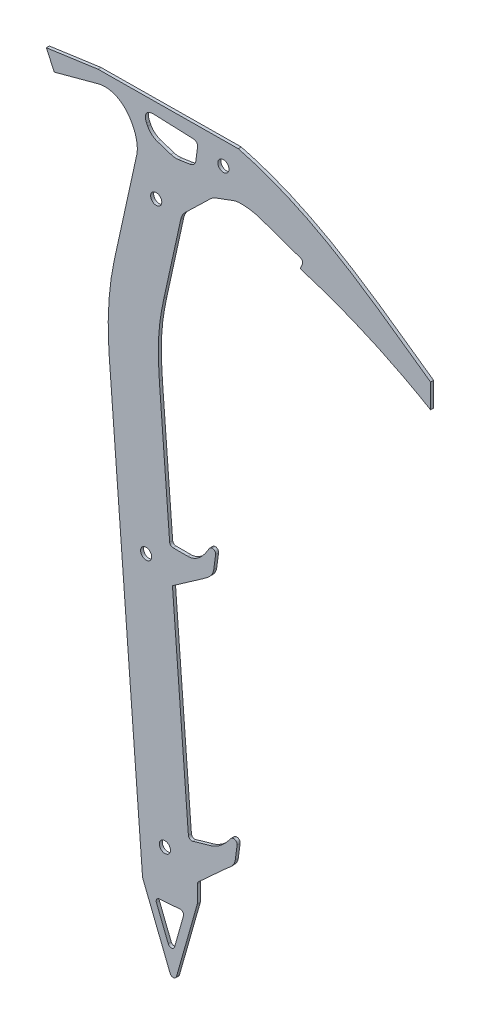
ISO-10303-21;
HEADER;
FILE_DESCRIPTION(('STEP AP214'),'2;1');
FILE_NAME('part.step','',(''),(''),'','','');
FILE_SCHEMA(('AUTOMOTIVE_DESIGN { 1 0 10303 214 1 1 1 1 }'));
ENDSEC;
DATA;
#1=APPLICATION_CONTEXT('core data for automotive mechanical design processes');
#2=APPLICATION_PROTOCOL_DEFINITION('international standard','automotive_design',2000,#1);
#3=PRODUCT_CONTEXT('',#1,'mechanical');
#4=PRODUCT('Part','Part','',(#3));
#5=PRODUCT_RELATED_PRODUCT_CATEGORY('part','',(#4));
#6=PRODUCT_DEFINITION_FORMATION('','',#4);
#7=PRODUCT_DEFINITION_CONTEXT('part definition',#1,'design');
#8=PRODUCT_DEFINITION('design','',#6,#7);
#9=PRODUCT_DEFINITION_SHAPE('','',#8);
#10=(LENGTH_UNIT() NAMED_UNIT(*) SI_UNIT(.MILLI.,.METRE.));
#11=(NAMED_UNIT(*) PLANE_ANGLE_UNIT() SI_UNIT($,.RADIAN.));
#12=(NAMED_UNIT(*) SI_UNIT($,.STERADIAN.) SOLID_ANGLE_UNIT());
#13=UNCERTAINTY_MEASURE_WITH_UNIT(LENGTH_MEASURE(1.E-05),#10,'distance_accuracy_value','');
#14=(GEOMETRIC_REPRESENTATION_CONTEXT(3) GLOBAL_UNCERTAINTY_ASSIGNED_CONTEXT((#13)) GLOBAL_UNIT_ASSIGNED_CONTEXT((#10,
#11,#12)) REPRESENTATION_CONTEXT('',''));
#15=CARTESIAN_POINT('',(0.,0.,0.));
#16=DIRECTION('',(0.,0.,1.));
#17=DIRECTION('',(1.,0.,0.));
#18=AXIS2_PLACEMENT_3D('',#15,#16,#17);
#19=CARTESIAN_POINT('',(-19.0211884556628,12.7458915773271,1.143));
#20=DIRECTION('',(0.,0.,1.));
#21=DIRECTION('',(1.,0.,0.));
#22=AXIS2_PLACEMENT_3D('',#19,#20,#21);
#23=PLANE('',#22);
#24=CARTESIAN_POINT('',(68.0092428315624,147.741681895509,1.143));
#25=DIRECTION('',(0.,0.,-1.));
#26=DIRECTION('',(-1.,0.,0.));
#27=AXIS2_PLACEMENT_3D('',#24,#25,#26);
#28=CIRCLE('',#27,4.21639999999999);
#29=CARTESIAN_POINT('',(63.7928428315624,147.741681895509,1.143));
#30=VERTEX_POINT('',#29);
#31=EDGE_CURVE('E1558',#30,#30,#28,.T.);
#32=ORIENTED_EDGE('',*,*,#31,.T.);
#33=EDGE_LOOP('',(#32));
#34=FACE_BOUND('',#33,.T.);
#35=CARTESIAN_POINT('',(17.0415445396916,100.638187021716,1.143));
#36=DIRECTION('',(0.,0.,-1.));
#37=DIRECTION('',(-1.,0.,0.));
#38=AXIS2_PLACEMENT_3D('',#35,#36,#37);
#39=CIRCLE('',#38,4.2164);
#40=CARTESIAN_POINT('',(12.8251445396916,100.638187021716,1.143));
#41=VERTEX_POINT('',#40);
#42=EDGE_CURVE('E1568',#41,#41,#39,.T.);
#43=ORIENTED_EDGE('',*,*,#42,.T.);
#44=EDGE_LOOP('',(#43));
#45=FACE_BOUND('',#44,.T.);
#46=CARTESIAN_POINT('',(9.38192910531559,-136.197405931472,1.143));
#47=DIRECTION('',(0.,0.,-1.));
#48=DIRECTION('',(-1.,0.,0.));
#49=AXIS2_PLACEMENT_3D('',#46,#47,#48);
#50=CIRCLE('',#49,4.2164);
#51=CARTESIAN_POINT('',(5.16552910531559,-136.197405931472,1.143));
#52=VERTEX_POINT('',#51);
#53=EDGE_CURVE('E1574',#52,#52,#50,.T.);
#54=ORIENTED_EDGE('',*,*,#53,.T.);
#55=EDGE_LOOP('',(#54));
#56=FACE_BOUND('',#55,.T.);
#57=CARTESIAN_POINT('',(23.6115412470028,-321.807230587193,1.143));
#58=DIRECTION('',(0.,0.,-1.));
#59=DIRECTION('',(-1.,0.,0.));
#60=AXIS2_PLACEMENT_3D('',#57,#58,#59);
#61=CIRCLE('',#60,4.2164);
#62=CARTESIAN_POINT('',(19.3951412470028,-321.807230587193,1.143));
#63=VERTEX_POINT('',#62);
#64=EDGE_CURVE('E806',#63,#63,#61,.T.);
#65=ORIENTED_EDGE('',*,*,#64,.T.);
#66=EDGE_LOOP('',(#65));
#67=FACE_BOUND('',#66,.T.);
#68=DIRECTION('',(0.214363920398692,0.976753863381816,0.));
#69=VECTOR('',#68,1.);
#70=CARTESIAN_POINT('',(39.1921974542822,112.700551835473,1.143));
#71=LINE('',#70,#69);
#72=CARTESIAN_POINT('',(22.8576667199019,38.2719074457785,1.143));
#73=VERTEX_POINT('',#72);
#74=CARTESIAN_POINT('',(35.6487056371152,96.5545543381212,1.143));
#75=VERTEX_POINT('',#74);
#76=EDGE_CURVE('E1071',#73,#75,#71,.T.);
#77=ORIENTED_EDGE('',*,*,#76,.T.);
#78=CARTESIAN_POINT('',(48.0534797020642,93.8321325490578,1.143));
#79=DIRECTION('',(0.,0.,1.));
#80=DIRECTION('',(1.,0.,0.));
#81=AXIS2_PLACEMENT_3D('',#78,#79,#80);
#82=CIRCLE('',#81,12.7);
#83=CARTESIAN_POINT('',(39.2224504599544,102.959176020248,1.143));
#84=VERTEX_POINT('',#83);
#85=EDGE_CURVE('E729',#75,#84,#82,.F.);
#86=ORIENTED_EDGE('',*,*,#85,.T.);
#87=DIRECTION('',(0.718664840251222,0.695356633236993,0.));
#88=VECTOR('',#87,1.);
#89=CARTESIAN_POINT('',(59.9636796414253,123.027712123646,1.143));
#90=LINE('',#89,#88);
#91=CARTESIAN_POINT('',(58.0460163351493,121.172243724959,1.143));
#92=VERTEX_POINT('',#91);
#93=EDGE_CURVE('E800',#84,#92,#90,.T.);
#94=ORIENTED_EDGE('',*,*,#93,.T.);
#95=CARTESIAN_POINT('',(66.8770455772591,112.045200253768,1.143));
#96=DIRECTION('',(0.,0.,1.));
#97=DIRECTION('',(1.,0.,0.));
#98=AXIS2_PLACEMENT_3D('',#95,#96,#97);
#99=CIRCLE('',#98,12.7);
#100=CARTESIAN_POINT('',(62.4659217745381,123.954523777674,1.143));
#101=VERTEX_POINT('',#100);
#102=EDGE_CURVE('E725',#92,#101,#99,.F.);
#103=ORIENTED_EDGE('',*,*,#102,.T.);
#104=DIRECTION('',(0.937742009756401,0.34733258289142,0.));
#105=VECTOR('',#104,1.);
#106=CARTESIAN_POINT('',(44.0168838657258,117.121138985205,1.143));
#107=LINE('',#106,#105);
#108=CARTESIAN_POINT('',(75.9104754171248,128.934285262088,1.143));
#109=VERTEX_POINT('',#108);
#110=EDGE_CURVE('E1067',#101,#109,#107,.T.);
#111=ORIENTED_EDGE('',*,*,#110,.T.);
#112=CARTESIAN_POINT('',(75.9104754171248,128.934285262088,1.143));
#113=CARTESIAN_POINT('',(80.0933409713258,130.483587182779,1.143));
#114=CARTESIAN_POINT('',(89.5482728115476,129.605354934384,1.143));
#115=CARTESIAN_POINT('',(95.8311565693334,127.39608281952,1.143));
#116=B_SPLINE_CURVE_WITH_KNOTS('',3,(#112,#113,#114,#115),.UNSPECIFIED.,.F.,.F.,(4,4),(0.,1.),.UNSPECIFIED.);
#117=CARTESIAN_POINT('',(95.8311565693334,127.39608281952,1.143));
#118=VERTEX_POINT('',#117);
#119=EDGE_CURVE('E1062',#109,#118,#116,.T.);
#120=ORIENTED_EDGE('',*,*,#119,.T.);
#121=DIRECTION('',(0.943376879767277,-0.331722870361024,0.));
#122=VECTOR('',#121,1.);
#123=CARTESIAN_POINT('',(129.004887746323,115.731089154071,1.143));
#124=LINE('',#123,#122);
#125=CARTESIAN_POINT('',(126.42212205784,116.639275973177,1.143));
#126=VERTEX_POINT('',#125);
#127=EDGE_CURVE('E863',#118,#126,#124,.T.);
#128=ORIENTED_EDGE('',*,*,#127,.T.);
#129=CARTESIAN_POINT('',(125.579545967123,114.243098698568,1.143));
#130=DIRECTION('',(0.,0.,1.));
#131=DIRECTION('',(1.,0.,0.));
#132=AXIS2_PLACEMENT_3D('',#129,#130,#131);
#133=CIRCLE('',#132,2.54);
#134=CARTESIAN_POINT('',(127.905938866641,113.223541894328,1.143));
#135=VERTEX_POINT('',#134);
#136=EDGE_CURVE('E860',#126,#135,#133,.F.);
#137=ORIENTED_EDGE('',*,*,#136,.T.);
#138=DIRECTION('',(-0.40140031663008,-0.915902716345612,0.));
#139=VECTOR('',#138,1.);
#140=CARTESIAN_POINT('',(126.268204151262,109.4866099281,1.143));
#141=LINE('',#140,#139);
#142=CARTESIAN_POINT('',(126.268204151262,109.4866099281,1.143));
#143=VERTEX_POINT('',#142);
#144=EDGE_CURVE('E862',#135,#143,#141,.T.);
#145=ORIENTED_EDGE('',*,*,#144,.T.);
#146=CARTESIAN_POINT('',(126.268204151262,109.4866099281,1.143));
#147=CARTESIAN_POINT('',(177.502207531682,94.1506746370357,1.143));
#148=CARTESIAN_POINT('',(225.139902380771,66.1554457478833,1.143));
#149=B_SPLINE_CURVE_WITH_KNOTS('',2,(#146,#147,#148),.UNSPECIFIED.,.F.,.F.,(3,3),(0.,1.),.UNSPECIFIED.);
#150=CARTESIAN_POINT('',(225.139902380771,66.1554457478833,1.143));
#151=VERTEX_POINT('',#150);
#152=EDGE_CURVE('E1035',#143,#151,#149,.T.);
#153=ORIENTED_EDGE('',*,*,#152,.T.);
#154=DIRECTION('',(0.,1.,0.));
#155=VECTOR('',#154,1.);
#156=CARTESIAN_POINT('',(225.139902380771,66.1554457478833,1.143));
#157=LINE('',#156,#155);
#158=CARTESIAN_POINT('',(225.139902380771,84.4452484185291,1.143));
#159=VERTEX_POINT('',#158);
#160=EDGE_CURVE('E1029',#151,#159,#157,.T.);
#161=ORIENTED_EDGE('',*,*,#160,.T.);
#162=CARTESIAN_POINT('',(225.139902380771,84.4452484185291,1.143));
#163=CARTESIAN_POINT('',(177.560633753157,118.105838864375,1.143));
#164=CARTESIAN_POINT('',(136.003162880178,149.987562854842,1.143));
#165=CARTESIAN_POINT('',(79.2400667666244,164.771545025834,1.143));
#166=B_SPLINE_CURVE_WITH_KNOTS('',3,(#162,#163,#164,#165),.UNSPECIFIED.,.F.,.F.,(4,4),(0.,1.),.UNSPECIFIED.);
#167=CARTESIAN_POINT('',(79.2400667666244,164.771545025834,1.143));
#168=VERTEX_POINT('',#167);
#169=EDGE_CURVE('E1023',#159,#168,#166,.T.);
#170=ORIENTED_EDGE('',*,*,#169,.T.);
#171=DIRECTION('',(-0.999958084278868,-0.00915585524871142,0.));
#172=VECTOR('',#171,1.);
#173=CARTESIAN_POINT('',(-27.1753907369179,163.797179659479,1.143));
#174=LINE('',#173,#172);
#175=CARTESIAN_POINT('',(-27.0097832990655,163.798696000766,1.143));
#176=VERTEX_POINT('',#175);
#177=EDGE_CURVE('E868',#168,#176,#174,.T.);
#178=ORIENTED_EDGE('',*,*,#177,.T.);
#179=CARTESIAN_POINT('',(-26.9865274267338,161.258802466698,1.143));
#180=DIRECTION('',(0.,0.,1.));
#181=DIRECTION('',(1.,0.,0.));
#182=AXIS2_PLACEMENT_3D('',#179,#180,#181);
#183=CIRCLE('',#182,2.54);
#184=CARTESIAN_POINT('',(-27.3393991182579,163.774171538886,1.143));
#185=VERTEX_POINT('',#184);
#186=EDGE_CURVE('E865',#176,#185,#183,.T.);
#187=ORIENTED_EDGE('',*,*,#186,.T.);
#188=DIRECTION('',(-0.990302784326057,-0.138925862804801,0.));
#189=VECTOR('',#188,1.);
#190=CARTESIAN_POINT('',(-66.2629681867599,158.313730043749,1.143));
#191=LINE('',#190,#189);
#192=CARTESIAN_POINT('',(-66.2629681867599,158.313730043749,1.143));
#193=VERTEX_POINT('',#192);
#194=EDGE_CURVE('E867',#185,#193,#191,.T.);
#195=ORIENTED_EDGE('',*,*,#194,.T.);
#196=DIRECTION('',(0.416827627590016,-0.908985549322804,0.));
#197=VECTOR('',#196,1.);
#198=CARTESIAN_POINT('',(-66.2629681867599,158.313730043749,1.143));
#199=LINE('',#198,#197);
#200=CARTESIAN_POINT('',(-60.2950505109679,145.299355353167,1.143));
#201=VERTEX_POINT('',#200);
#202=EDGE_CURVE('E1127',#193,#201,#199,.T.);
#203=ORIENTED_EDGE('',*,*,#202,.T.);
#204=DIRECTION('',(0.96561138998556,0.259989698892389,0.));
#205=VECTOR('',#204,1.);
#206=CARTESIAN_POINT('',(-27.1753907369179,154.21678369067,1.143));
#207=LINE('',#206,#205);
#208=CARTESIAN_POINT('',(-27.1753907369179,154.21678369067,1.143));
#209=VERTEX_POINT('',#208);
#210=EDGE_CURVE('E991',#201,#209,#207,.T.);
#211=ORIENTED_EDGE('',*,*,#210,.T.);
#212=CARTESIAN_POINT('',(-27.1753907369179,154.21678369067,1.143));
#213=CARTESIAN_POINT('',(-21.3119540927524,155.795506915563,1.143));
#214=CARTESIAN_POINT('',(-9.16205195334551,153.443457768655,1.143));
#215=CARTESIAN_POINT('',(1.53650161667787,138.586858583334,1.143));
#216=CARTESIAN_POINT('',(3.29563203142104,126.872204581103,1.143));
#217=CARTESIAN_POINT('',(2.22884875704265,122.011383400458,1.143));
#218=B_SPLINE_CURVE_WITH_KNOTS('',3,(#212,#213,#214,#215,#216,#217),.UNSPECIFIED.,.F.,.F.,(4,1,
1,4),(0.,0.318927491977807,0.707775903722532,1.),.UNSPECIFIED.);
#219=CARTESIAN_POINT('',(2.22884875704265,122.011383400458,1.143));
#220=VERTEX_POINT('',#219);
#221=EDGE_CURVE('E986',#209,#220,#218,.T.);
#222=ORIENTED_EDGE('',*,*,#221,.T.);
#223=DIRECTION('',(-0.214363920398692,-0.976753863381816,0.));
#224=VECTOR('',#223,1.);
#225=CARTESIAN_POINT('',(2.22884875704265,122.011383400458,1.143));
#226=LINE('',#225,#224);
#227=CARTESIAN_POINT('',(-14.7862874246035,44.4815454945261,1.143));
#228=VERTEX_POINT('',#227);
#229=EDGE_CURVE('E591',#220,#228,#226,.T.);
#230=ORIENTED_EDGE('',*,*,#229,.T.);
#231=CARTESIAN_POINT('',(-14.7862874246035,44.4815454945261,1.143));
#232=CARTESIAN_POINT('',(-19.2789138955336,24.0107953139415,1.143));
#233=CARTESIAN_POINT('',(-20.3298908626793,2.14529170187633,1.143));
#234=CARTESIAN_POINT('',(-18.5568059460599,-20.9826739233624,1.143));
#235=B_SPLINE_CURVE_WITH_KNOTS('',3,(#231,#232,#233,#234),.UNSPECIFIED.,.F.,.F.,(4,4),(0.,1.),.UNSPECIFIED.);
#236=CARTESIAN_POINT('',(-18.5568059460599,-20.9826739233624,1.143));
#237=VERTEX_POINT('',#236);
#238=EDGE_CURVE('E584',#228,#237,#235,.T.);
#239=ORIENTED_EDGE('',*,*,#238,.T.);
#240=DIRECTION('',(0.0764398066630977,-0.997074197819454,0.));
#241=VECTOR('',#240,1.);
#242=CARTESIAN_POINT('',(-18.5568059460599,-20.9826739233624,1.143));
#243=LINE('',#242,#241);
#244=CARTESIAN_POINT('',(6.65403011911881,-349.830629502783,1.143));
#245=VERTEX_POINT('',#244);
#246=EDGE_CURVE('E590',#237,#245,#243,.T.);
#247=ORIENTED_EDGE('',*,*,#246,.T.);
#248=CARTESIAN_POINT('',(9.18659858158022,-349.636472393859,1.143));
#249=DIRECTION('',(0.,0.,1.));
#250=DIRECTION('',(1.,0.,0.));
#251=AXIS2_PLACEMENT_3D('',#248,#249,#250);
#252=CIRCLE('',#251,2.54);
#253=CARTESIAN_POINT('',(6.82682358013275,-350.576186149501,1.143));
#254=VERTEX_POINT('',#253);
#255=EDGE_CURVE('E1151',#245,#254,#252,.T.);
#256=ORIENTED_EDGE('',*,*,#255,.T.);
#257=DIRECTION('',(0.369966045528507,-0.929045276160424,0.));
#258=VECTOR('',#257,1.);
#259=CARTESIAN_POINT('',(30.3446481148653,-409.633291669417,1.143));
#260=LINE('',#259,#258);
#261=CARTESIAN_POINT('',(27.5845787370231,-402.702305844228,1.143));
#262=VERTEX_POINT('',#261);
#263=EDGE_CURVE('E832',#254,#262,#260,.T.);
#264=ORIENTED_EDGE('',*,*,#263,.T.);
#265=CARTESIAN_POINT('',(29.9443537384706,-401.762592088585,1.143));
#266=DIRECTION('',(0.,0.,1.));
#267=DIRECTION('',(1.,0.,0.));
#268=AXIS2_PLACEMENT_3D('',#265,#266,#267);
#269=CIRCLE('',#268,2.54);
#270=CARTESIAN_POINT('',(32.3872913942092,-402.458045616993,1.143));
#271=VERTEX_POINT('',#270);
#272=EDGE_CURVE('E1155',#262,#271,#269,.T.);
#273=ORIENTED_EDGE('',*,*,#272,.T.);
#274=DIRECTION('',(0.273800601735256,0.961786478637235,0.));
#275=VECTOR('',#274,1.);
#276=CARTESIAN_POINT('',(48.1646619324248,-347.036466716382,1.143));
#277=LINE('',#276,#275);
#278=CARTESIAN_POINT('',(48.0675995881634,-347.377420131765,1.143));
#279=VERTEX_POINT('',#278);
#280=EDGE_CURVE('E835',#271,#279,#277,.T.);
#281=ORIENTED_EDGE('',*,*,#280,.T.);
#282=CARTESIAN_POINT('',(45.6246619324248,-346.681966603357,1.143));
#283=DIRECTION('',(0.,0.,1.));
#284=DIRECTION('',(1.,0.,0.));
#285=AXIS2_PLACEMENT_3D('',#282,#283,#284);
#286=CIRCLE('',#285,2.54);
#287=CARTESIAN_POINT('',(48.1646619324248,-346.681966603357,1.143));
#288=VERTEX_POINT('',#287);
#289=EDGE_CURVE('E840',#279,#288,#286,.T.);
#290=ORIENTED_EDGE('',*,*,#289,.T.);
#291=DIRECTION('',(0.,1.,0.));
#292=VECTOR('',#291,1.);
#293=CARTESIAN_POINT('',(48.1646619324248,-332.698935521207,1.143));
#294=LINE('',#293,#292);
#295=CARTESIAN_POINT('',(48.1646619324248,-333.81690500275,1.143));
#296=VERTEX_POINT('',#295);
#297=EDGE_CURVE('E455',#288,#296,#294,.T.);
#298=ORIENTED_EDGE('',*,*,#297,.T.);
#299=CARTESIAN_POINT('',(50.7046619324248,-333.81690500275,1.143));
#300=DIRECTION('',(0.,0.,1.));
#301=DIRECTION('',(1.,0.,0.));
#302=AXIS2_PLACEMENT_3D('',#299,#300,#301);
#303=CIRCLE('',#302,2.54);
#304=CARTESIAN_POINT('',(48.9890862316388,-331.943832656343,1.143));
#305=VERTEX_POINT('',#304);
#306=EDGE_CURVE('E451',#296,#305,#303,.F.);
#307=ORIENTED_EDGE('',*,*,#306,.T.);
#308=DIRECTION('',(0.737430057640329,0.675423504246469,0.));
#309=VECTOR('',#308,1.);
#310=CARTESIAN_POINT('',(48.1646619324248,-332.698935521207,1.143));
#311=LINE('',#310,#309);
#312=CARTESIAN_POINT('',(69.0746525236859,-313.547154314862,1.143));
#313=VERTEX_POINT('',#312);
#314=EDGE_CURVE('E442',#305,#313,#311,.T.);
#315=ORIENTED_EDGE('',*,*,#314,.T.);
#316=CARTESIAN_POINT('',(69.0746525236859,-313.547154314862,1.143));
#317=CARTESIAN_POINT('',(72.1842997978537,-310.698980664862,1.143));
#318=CARTESIAN_POINT('',(76.3504602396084,-308.232220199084,1.143));
#319=CARTESIAN_POINT('',(76.9663603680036,-303.659842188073,1.143));
#320=B_SPLINE_CURVE_WITH_KNOTS('',3,(#316,#317,#318,#319),.UNSPECIFIED.,.F.,.F.,(4,4),(0.,1.),.UNSPECIFIED.);
#321=CARTESIAN_POINT('',(76.9663603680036,-303.659842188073,1.143));
#322=VERTEX_POINT('',#321);
#323=EDGE_CURVE('E447',#313,#322,#320,.T.);
#324=ORIENTED_EDGE('',*,*,#323,.T.);
#325=DIRECTION('',(0.133494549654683,0.99104954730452,0.));
#326=VECTOR('',#325,1.);
#327=CARTESIAN_POINT('',(78.7824480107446,-290.177397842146,1.143));
#328=LINE('',#327,#326);
#329=CARTESIAN_POINT('',(78.394635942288,-293.056473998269,1.143));
#330=VERTEX_POINT('',#329);
#331=EDGE_CURVE('E470',#322,#330,#328,.T.);
#332=ORIENTED_EDGE('',*,*,#331,.T.);
#333=CARTESIAN_POINT('',(75.8773700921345,-292.717397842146,1.143));
#334=DIRECTION('',(0.,0.,1.));
#335=DIRECTION('',(1.,0.,0.));
#336=AXIS2_PLACEMENT_3D('',#333,#334,#335);
#337=CIRCLE('',#336,2.54);
#338=CARTESIAN_POINT('',(75.8773700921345,-290.177397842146,1.143));
#339=VERTEX_POINT('',#338);
#340=EDGE_CURVE('E1252',#330,#339,#337,.T.);
#341=ORIENTED_EDGE('',*,*,#340,.T.);
#342=DIRECTION('',(-1.,0.,0.));
#343=VECTOR('',#342,1.);
#344=CARTESIAN_POINT('',(78.7824480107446,-290.177397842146,1.143));
#345=LINE('',#344,#343);
#346=CARTESIAN_POINT('',(75.6592750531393,-290.177397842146,1.143));
#347=VERTEX_POINT('',#346);
#348=EDGE_CURVE('E472',#339,#347,#345,.T.);
#349=ORIENTED_EDGE('',*,*,#348,.T.);
#350=CARTESIAN_POINT('',(75.6592750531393,-292.717397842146,1.143));
#351=DIRECTION('',(0.,0.,1.));
#352=DIRECTION('',(1.,0.,0.));
#353=AXIS2_PLACEMENT_3D('',#350,#351,#352);
#354=CIRCLE('',#353,2.54);
#355=CARTESIAN_POINT('',(73.5943919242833,-291.238256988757,1.143));
#356=VERTEX_POINT('',#355);
#357=EDGE_CURVE('E1254',#347,#356,#354,.T.);
#358=ORIENTED_EDGE('',*,*,#357,.T.);
#359=CARTESIAN_POINT('',(74.3357910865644,-290.177397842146,1.143));
#360=CARTESIAN_POINT('',(66.9349578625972,-301.027986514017,1.143));
#361=CARTESIAN_POINT('',(58.0168664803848,-303.581901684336,1.143));
#362=B_SPLINE_CURVE_WITH_KNOTS('',2,(#359,#360,#361),.UNSPECIFIED.,.F.,.F.,(3,3),(0.,1.),.UNSPECIFIED.);
#363=CARTESIAN_POINT('',(58.0168664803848,-303.581901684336,1.143));
#364=VERTEX_POINT('',#363);
#365=EDGE_CURVE('E1259',#356,#364,#362,.T.);
#366=ORIENTED_EDGE('',*,*,#365,.T.);
#367=DIRECTION('',(-0.96135607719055,-0.275307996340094,0.));
#368=VECTOR('',#367,1.);
#369=CARTESIAN_POINT('',(41.6789069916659,-308.260678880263,1.143));
#370=LINE('',#369,#368);
#371=CARTESIAN_POINT('',(44.6727128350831,-307.403328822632,1.143));
#372=VERTEX_POINT('',#371);
#373=EDGE_CURVE('E1269',#364,#372,#370,.T.);
#374=ORIENTED_EDGE('',*,*,#373,.T.);
#375=CARTESIAN_POINT('',(43.9734305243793,-304.961484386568,1.143));
#376=DIRECTION('',(0.,0.,1.));
#377=DIRECTION('',(1.,0.,0.));
#378=AXIS2_PLACEMENT_3D('',#375,#376,#377);
#379=CIRCLE('',#378,2.54);
#380=CARTESIAN_POINT('',(41.4408620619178,-305.155641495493,1.143));
#381=VERTEX_POINT('',#380);
#382=EDGE_CURVE('E849',#372,#381,#379,.F.);
#383=ORIENTED_EDGE('',*,*,#382,.T.);
#384=DIRECTION('',(-0.0764398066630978,0.997074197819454,0.));
#385=VECTOR('',#384,1.);
#386=CARTESIAN_POINT('',(29.3333298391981,-147.226042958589,1.143));
#387=LINE('',#386,#385);
#388=CARTESIAN_POINT('',(29.3333298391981,-147.226042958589,1.143));
#389=VERTEX_POINT('',#388);
#390=EDGE_CURVE('E1996',#381,#389,#387,.T.);
#391=ORIENTED_EDGE('',*,*,#390,.T.);
#392=DIRECTION('',(0.82040362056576,0.571784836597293,0.));
#393=VECTOR('',#392,1.);
#394=CARTESIAN_POINT('',(29.3333298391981,-147.226042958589,1.143));
#395=LINE('',#394,#393);
#396=CARTESIAN_POINT('',(52.7557279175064,-130.901673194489,1.143));
#397=VERTEX_POINT('',#396);
#398=EDGE_CURVE('E1987',#389,#397,#395,.T.);
#399=ORIENTED_EDGE('',*,*,#398,.T.);
#400=CARTESIAN_POINT('',(52.7557279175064,-130.901673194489,1.143));
#401=CARTESIAN_POINT('',(56.2152639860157,-128.490530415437,1.143));
#402=CARTESIAN_POINT('',(60.0315356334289,-125.586739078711,1.143));
#403=CARTESIAN_POINT('',(60.6474357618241,-121.0143610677,1.143));
#404=B_SPLINE_CURVE_WITH_KNOTS('',3,(#400,#401,#402,#403),.UNSPECIFIED.,.F.,.F.,(4,4),(0.,1.),.UNSPECIFIED.);
#405=CARTESIAN_POINT('',(60.6474357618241,-121.0143610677,1.143));
#406=VERTEX_POINT('',#405);
#407=EDGE_CURVE('E1985',#397,#406,#404,.T.);
#408=ORIENTED_EDGE('',*,*,#407,.T.);
#409=DIRECTION('',(0.133494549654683,0.99104954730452,0.));
#410=VECTOR('',#409,1.);
#411=CARTESIAN_POINT('',(62.4635234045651,-107.531916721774,1.143));
#412=LINE('',#411,#410);
#413=CARTESIAN_POINT('',(62.0757113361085,-110.410992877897,1.143));
#414=VERTEX_POINT('',#413);
#415=EDGE_CURVE('E1984',#406,#414,#412,.T.);
#416=ORIENTED_EDGE('',*,*,#415,.T.);
#417=CARTESIAN_POINT('',(59.558445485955,-110.071916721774,1.143));
#418=DIRECTION('',(0.,0.,1.));
#419=DIRECTION('',(1.,0.,0.));
#420=AXIS2_PLACEMENT_3D('',#417,#418,#419);
#421=CIRCLE('',#420,2.54);
#422=CARTESIAN_POINT('',(59.558445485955,-107.531916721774,1.143));
#423=VERTEX_POINT('',#422);
#424=EDGE_CURVE('E1248',#414,#423,#421,.T.);
#425=ORIENTED_EDGE('',*,*,#424,.T.);
#426=DIRECTION('',(-1.,0.,0.));
#427=VECTOR('',#426,1.);
#428=CARTESIAN_POINT('',(62.4635234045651,-107.531916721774,1.143));
#429=LINE('',#428,#427);
#430=CARTESIAN_POINT('',(59.5153247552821,-107.531916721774,1.143));
#431=VERTEX_POINT('',#430);
#432=EDGE_CURVE('E1366',#423,#431,#429,.T.);
#433=ORIENTED_EDGE('',*,*,#432,.T.);
#434=CARTESIAN_POINT('',(59.5153247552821,-110.071916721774,1.143));
#435=DIRECTION('',(0.,0.,1.));
#436=DIRECTION('',(1.,0.,0.));
#437=AXIS2_PLACEMENT_3D('',#434,#435,#436);
#438=CIRCLE('',#437,2.54);
#439=CARTESIAN_POINT('',(57.3066049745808,-108.817661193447,1.143));
#440=VERTEX_POINT('',#439);
#441=EDGE_CURVE('E1250',#431,#440,#438,.T.);
#442=ORIENTED_EDGE('',*,*,#441,.T.);
#443=CARTESIAN_POINT('',(58.0168664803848,-107.531916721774,1.143));
#444=CARTESIAN_POINT('',(50.1965242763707,-122.077096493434,1.143));
#445=CARTESIAN_POINT('',(40.9199496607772,-122.077096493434,1.143));
#446=B_SPLINE_CURVE_WITH_KNOTS('',2,(#443,#444,#445),.UNSPECIFIED.,.F.,.F.,(3,3),(0.,1.),.UNSPECIFIED.);
#447=CARTESIAN_POINT('',(40.9199496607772,-122.077096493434,1.143));
#448=VERTEX_POINT('',#447);
#449=EDGE_CURVE('E1360',#440,#448,#446,.T.);
#450=ORIENTED_EDGE('',*,*,#449,.T.);
#451=DIRECTION('',(-1.,0.,0.));
#452=VECTOR('',#451,1.);
#453=CARTESIAN_POINT('',(27.4053082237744,-122.077096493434,1.143));
#454=LINE('',#453,#452);
#455=CARTESIAN_POINT('',(29.7580347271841,-122.077096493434,1.143));
#456=VERTEX_POINT('',#455);
#457=EDGE_CURVE('E1324',#448,#456,#454,.T.);
#458=ORIENTED_EDGE('',*,*,#457,.T.);
#459=CARTESIAN_POINT('',(29.7580347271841,-119.537096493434,1.143));
#460=DIRECTION('',(0.,0.,1.));
#461=DIRECTION('',(1.,0.,0.));
#462=AXIS2_PLACEMENT_3D('',#459,#460,#461);
#463=CIRCLE('',#462,2.54);
#464=CARTESIAN_POINT('',(27.2254662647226,-119.731253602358,1.143));
#465=VERTEX_POINT('',#464);
#466=EDGE_CURVE('E756',#456,#465,#463,.F.);
#467=ORIENTED_EDGE('',*,*,#466,.T.);
#468=DIRECTION('',(-0.0764398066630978,0.997074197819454,0.));
#469=VECTOR('',#468,1.);
#470=CARTESIAN_POINT('',(33.2300214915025,-198.054150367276,1.143));
#471=LINE('',#470,#469);
#472=CARTESIAN_POINT('',(19.4317209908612,-18.0703172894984,1.143));
#473=VERTEX_POINT('',#472);
#474=EDGE_CURVE('E754',#465,#473,#471,.T.);
#475=ORIENTED_EDGE('',*,*,#474,.T.);
#476=CARTESIAN_POINT('',(19.4317209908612,-18.0703172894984,1.143));
#477=CARTESIAN_POINT('',(17.9934732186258,0.690061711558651,1.143));
#478=CARTESIAN_POINT('',(17.7895180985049,15.1787780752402,1.143));
#479=CARTESIAN_POINT('',(22.8576667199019,38.2719074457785,1.143));
#480=B_SPLINE_CURVE_WITH_KNOTS('',3,(#476,#477,#478,#479),.UNSPECIFIED.,.F.,.F.,(4,4),(0.,1.),.UNSPECIFIED.);
#481=EDGE_CURVE('E592',#473,#73,#480,.T.);
#482=ORIENTED_EDGE('',*,*,#481,.T.);
#483=EDGE_LOOP('',(#77,#86,#94,#103,#111,#120,#128,#137,#145,#153,#161,#170,#178,#187,#195,#203,
#211,#222,#230,#239,#247,#256,#264,#273,#281,#290,#298,#307,#315,#324,#332,#341,#349,#358,#366,
#374,#383,#391,#399,#408,#416,#425,#433,#442,#450,#458,#467,#475,#482));
#484=FACE_BOUND('',#483,.T.);
#485=DIRECTION('',(0.450091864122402,-0.892982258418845,0.));
#486=VECTOR('',#485,1.);
#487=CARTESIAN_POINT('',(9.73340656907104,146.855761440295,1.143));
#488=LINE('',#487,#486);
#489=CARTESIAN_POINT('',(9.73340656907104,146.855761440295,1.143));
#490=VERTEX_POINT('',#489);
#491=CARTESIAN_POINT('',(10.5709948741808,145.193986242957,1.143));
#492=VERTEX_POINT('',#491);
#493=EDGE_CURVE('E603',#490,#492,#488,.T.);
#494=ORIENTED_EDGE('',*,*,#493,.F.);
#495=CARTESIAN_POINT('',(15.7887965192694,155.37436086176,1.143));
#496=CARTESIAN_POINT('',(7.67842661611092,155.695324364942,1.143));
#497=CARTESIAN_POINT('',(8.16535843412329,149.966768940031,1.143));
#498=CARTESIAN_POINT('',(9.73340656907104,146.855761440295,1.143));
#499=B_SPLINE_CURVE_WITH_KNOTS('',3,(#495,#496,#497,#498),.UNSPECIFIED.,.F.,.F.,(4,4),(0.,1.),.UNSPECIFIED.);
#500=CARTESIAN_POINT('',(15.7887965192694,155.37436086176,1.143));
#501=VERTEX_POINT('',#500);
#502=EDGE_CURVE('E604',#501,#490,#499,.T.);
#503=ORIENTED_EDGE('',*,*,#502,.F.);
#504=DIRECTION('',(-0.999217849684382,0.0395435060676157,0.));
#505=VECTOR('',#504,1.);
#506=CARTESIAN_POINT('',(15.7887965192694,155.37436086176,1.143));
#507=LINE('',#506,#505);
#508=CARTESIAN_POINT('',(45.0394089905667,154.21678369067,1.143));
#509=VERTEX_POINT('',#508);
#510=EDGE_CURVE('E618',#509,#501,#507,.T.);
#511=ORIENTED_EDGE('',*,*,#510,.F.);
#512=CARTESIAN_POINT('',(48.426322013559,150.499258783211,1.143));
#513=CARTESIAN_POINT('',(48.6578242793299,152.171219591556,1.143));
#514=CARTESIAN_POINT('',(47.6866953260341,154.112018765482,1.143));
#515=CARTESIAN_POINT('',(45.0394089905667,154.21678369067,1.143));
#516=B_SPLINE_CURVE_WITH_KNOTS('',3,(#512,#513,#514,#515),.UNSPECIFIED.,.F.,.F.,(4,4),(0.,1.),.UNSPECIFIED.);
#517=CARTESIAN_POINT('',(48.426322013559,150.499258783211,1.143));
#518=VERTEX_POINT('',#517);
#519=EDGE_CURVE('E615',#518,#509,#516,.T.);
#520=ORIENTED_EDGE('',*,*,#519,.F.);
#521=DIRECTION('',(0.13715305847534,0.990549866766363,0.));
#522=VECTOR('',#521,1.);
#523=CARTESIAN_POINT('',(48.426322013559,150.499258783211,1.143));
#524=LINE('',#523,#522);
#525=CARTESIAN_POINT('',(47.0407666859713,140.492470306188,1.143));
#526=VERTEX_POINT('',#525);
#527=EDGE_CURVE('E612',#526,#518,#524,.T.);
#528=ORIENTED_EDGE('',*,*,#527,.F.);
#529=CARTESIAN_POINT('',(42.3709320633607,136.233170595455,1.143));
#530=CARTESIAN_POINT('',(45.2602948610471,136.674143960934,1.143));
#531=CARTESIAN_POINT('',(46.7518070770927,138.40553979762,1.143));
#532=CARTESIAN_POINT('',(47.0407666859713,140.492470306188,1.143));
#533=B_SPLINE_CURVE_WITH_KNOTS('',3,(#529,#530,#531,#532),.UNSPECIFIED.,.F.,.F.,(4,4),(0.,1.),.UNSPECIFIED.);
#534=CARTESIAN_POINT('',(42.3709320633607,136.233170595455,1.143));
#535=VERTEX_POINT('',#534);
#536=EDGE_CURVE('E608',#535,#526,#533,.T.);
#537=ORIENTED_EDGE('',*,*,#536,.F.);
#538=DIRECTION('',(0.988553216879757,0.150872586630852,0.));
#539=VECTOR('',#538,1.);
#540=CARTESIAN_POINT('',(19.8428287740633,132.794940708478,1.143));
#541=LINE('',#540,#539);
#542=CARTESIAN_POINT('',(34.1086610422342,134.97218617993,1.143));
#543=VERTEX_POINT('',#542);
#544=EDGE_CURVE('E609',#543,#535,#541,.T.);
#545=ORIENTED_EDGE('',*,*,#544,.F.);
#546=CARTESIAN_POINT('',(32.1925791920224,147.526812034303,1.143));
#547=DIRECTION('',(0.,0.,1.));
#548=DIRECTION('',(1.,0.,0.));
#549=AXIS2_PLACEMENT_3D('',#546,#547,#548);
#550=CIRCLE('',#549,12.7);
#551=CARTESIAN_POINT('',(28.2225208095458,135.463286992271,1.143));
#552=VERTEX_POINT('',#551);
#553=EDGE_CURVE('E719',#543,#552,#550,.F.);
#554=ORIENTED_EDGE('',*,*,#553,.T.);
#555=DIRECTION('',(-0.949883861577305,0.312603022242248,0.));
#556=VECTOR('',#555,1.);
#557=CARTESIAN_POINT('',(12.9407105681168,140.492470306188,1.143));
#558=LINE('',#557,#556);
#559=CARTESIAN_POINT('',(17.9418111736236,138.84662787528,1.143));
#560=VERTEX_POINT('',#559);
#561=EDGE_CURVE('E801',#552,#560,#558,.T.);
#562=ORIENTED_EDGE('',*,*,#561,.T.);
#563=CARTESIAN_POINT('',(21.9118695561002,150.910152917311,1.143));
#564=DIRECTION('',(0.,0.,1.));
#565=DIRECTION('',(1.,0.,0.));
#566=AXIS2_PLACEMENT_3D('',#563,#564,#565);
#567=CIRCLE('',#566,12.7);
#568=EDGE_CURVE('E45',#560,#492,#567,.F.);
#569=ORIENTED_EDGE('',*,*,#568,.T.);
#570=EDGE_LOOP('',(#494,#503,#511,#520,#528,#537,#545,#554,#562,#569));
#571=FACE_BOUND('',#570,.T.);
#572=DIRECTION('',(-0.997074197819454,-0.0764398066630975,0.));
#573=VECTOR('',#572,1.);
#574=CARTESIAN_POINT('',(15.9069158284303,-358.224789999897,1.143));
#575=LINE('',#574,#573);
#576=CARTESIAN_POINT('',(35.0607016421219,-356.756382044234,1.143));
#577=VERTEX_POINT('',#576);
#578=CARTESIAN_POINT('',(19.3501523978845,-357.960817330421,1.143));
#579=VERTEX_POINT('',#578);
#580=EDGE_CURVE('E817',#577,#579,#575,.T.);
#581=ORIENTED_EDGE('',*,*,#580,.F.);
#582=CARTESIAN_POINT('',(35.2548587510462,-359.288950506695,1.143));
#583=DIRECTION('',(0.,0.,1.));
#584=DIRECTION('',(1.,0.,0.));
#585=AXIS2_PLACEMENT_3D('',#582,#583,#584);
#586=CIRCLE('',#585,2.54);
#587=CARTESIAN_POINT('',(37.6977964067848,-359.984404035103,1.143));
#588=VERTEX_POINT('',#587);
#589=EDGE_CURVE('E851',#577,#588,#586,.F.);
#590=ORIENTED_EDGE('',*,*,#589,.T.);
#591=DIRECTION('',(0.273800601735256,0.961786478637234,0.));
#592=VECTOR('',#591,1.);
#593=CARTESIAN_POINT('',(28.905993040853,-390.867599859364,1.143));
#594=LINE('',#593,#592);
#595=CARTESIAN_POINT('',(30.9486363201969,-383.69235380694,1.143));
#596=VERTEX_POINT('',#595);
#597=EDGE_CURVE('E814',#596,#588,#594,.T.);
#598=ORIENTED_EDGE('',*,*,#597,.F.);
#599=CARTESIAN_POINT('',(28.5056986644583,-382.996900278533,1.143));
#600=DIRECTION('',(0.,0.,1.));
#601=DIRECTION('',(1.,0.,0.));
#602=AXIS2_PLACEMENT_3D('',#599,#600,#601);
#603=CIRCLE('',#602,2.54);
#604=CARTESIAN_POINT('',(26.1459236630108,-383.936614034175,1.143));
#605=VERTEX_POINT('',#604);
#606=EDGE_CURVE('E1202',#596,#605,#603,.F.);
#607=ORIENTED_EDGE('',*,*,#606,.T.);
#608=DIRECTION('',(0.369966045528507,-0.929045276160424,0.));
#609=VECTOR('',#608,1.);
#610=CARTESIAN_POINT('',(15.9069158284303,-358.224789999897,1.143));
#611=LINE('',#610,#609);
#612=CARTESIAN_POINT('',(17.1845345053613,-361.433099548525,1.143));
#613=VERTEX_POINT('',#612);
#614=EDGE_CURVE('E821',#613,#605,#611,.T.);
#615=ORIENTED_EDGE('',*,*,#614,.F.);
#616=CARTESIAN_POINT('',(19.5443095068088,-360.493385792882,1.143));
#617=DIRECTION('',(0.,0.,1.));
#618=DIRECTION('',(1.,0.,0.));
#619=AXIS2_PLACEMENT_3D('',#616,#617,#618);
#620=CIRCLE('',#619,2.54);
#621=EDGE_CURVE('E1206',#613,#579,#620,.F.);
#622=ORIENTED_EDGE('',*,*,#621,.T.);
#623=EDGE_LOOP('',(#581,#590,#598,#607,#615,#622));
#624=FACE_BOUND('',#623,.T.);
#625=ADVANCED_FACE('F37',(#34,#45,#56,#67,#484,#571,#624),#23,.T.);
#626=CARTESIAN_POINT('',(-19.0211884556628,12.7458915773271,-1.143));
#627=DIRECTION('',(0.,0.,1.));
#628=DIRECTION('',(1.,0.,0.));
#629=AXIS2_PLACEMENT_3D('',#626,#627,#628);
#630=PLANE('',#629);
#631=CARTESIAN_POINT('',(68.0092428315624,147.741681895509,-1.143));
#632=DIRECTION('',(0.,0.,-1.));
#633=DIRECTION('',(-1.,0.,0.));
#634=AXIS2_PLACEMENT_3D('',#631,#632,#633);
#635=CIRCLE('',#634,4.21639999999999);
#636=CARTESIAN_POINT('',(63.7928428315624,147.741681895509,-1.143));
#637=VERTEX_POINT('',#636);
#638=EDGE_CURVE('E1561',#637,#637,#635,.T.);
#639=ORIENTED_EDGE('',*,*,#638,.F.);
#640=EDGE_LOOP('',(#639));
#641=FACE_BOUND('',#640,.T.);
#642=CARTESIAN_POINT('',(17.0415445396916,100.638187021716,-1.143));
#643=DIRECTION('',(0.,0.,-1.));
#644=DIRECTION('',(-1.,0.,0.));
#645=AXIS2_PLACEMENT_3D('',#642,#643,#644);
#646=CIRCLE('',#645,4.21639999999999);
#647=CARTESIAN_POINT('',(12.8251445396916,100.638187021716,-1.143));
#648=VERTEX_POINT('',#647);
#649=EDGE_CURVE('E1563',#648,#648,#646,.T.);
#650=ORIENTED_EDGE('',*,*,#649,.F.);
#651=EDGE_LOOP('',(#650));
#652=FACE_BOUND('',#651,.T.);
#653=CARTESIAN_POINT('',(9.38192910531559,-136.197405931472,-1.143));
#654=DIRECTION('',(0.,0.,-1.));
#655=DIRECTION('',(-1.,0.,0.));
#656=AXIS2_PLACEMENT_3D('',#653,#654,#655);
#657=CIRCLE('',#656,4.21639999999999);
#658=CARTESIAN_POINT('',(5.1655291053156,-136.197405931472,-1.143));
#659=VERTEX_POINT('',#658);
#660=EDGE_CURVE('E1571',#659,#659,#657,.T.);
#661=ORIENTED_EDGE('',*,*,#660,.F.);
#662=EDGE_LOOP('',(#661));
#663=FACE_BOUND('',#662,.T.);
#664=CARTESIAN_POINT('',(23.6115412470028,-321.807230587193,-1.143));
#665=DIRECTION('',(0.,0.,-1.));
#666=DIRECTION('',(-1.,0.,0.));
#667=AXIS2_PLACEMENT_3D('',#664,#665,#666);
#668=CIRCLE('',#667,4.21639999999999);
#669=CARTESIAN_POINT('',(19.3951412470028,-321.807230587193,-1.143));
#670=VERTEX_POINT('',#669);
#671=EDGE_CURVE('E1576',#670,#670,#668,.T.);
#672=ORIENTED_EDGE('',*,*,#671,.F.);
#673=EDGE_LOOP('',(#672));
#674=FACE_BOUND('',#673,.T.);
#675=DIRECTION('',(0.450091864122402,-0.892982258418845,0.));
#676=VECTOR('',#675,1.);
#677=CARTESIAN_POINT('',(9.73340656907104,146.855761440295,-1.143));
#678=LINE('',#677,#676);
#679=CARTESIAN_POINT('',(9.73340656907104,146.855761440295,-1.143));
#680=VERTEX_POINT('',#679);
#681=CARTESIAN_POINT('',(10.5709948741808,145.193986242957,-1.143));
#682=VERTEX_POINT('',#681);
#683=EDGE_CURVE('E648',#680,#682,#678,.T.);
#684=ORIENTED_EDGE('',*,*,#683,.T.);
#685=CARTESIAN_POINT('',(21.9118695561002,150.910152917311,-1.143));
#686=DIRECTION('',(0.,0.,1.));
#687=DIRECTION('',(1.,0.,0.));
#688=AXIS2_PLACEMENT_3D('',#685,#686,#687);
#689=CIRCLE('',#688,12.7);
#690=CARTESIAN_POINT('',(17.9418111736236,138.84662787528,-1.143));
#691=VERTEX_POINT('',#690);
#692=EDGE_CURVE('E11',#682,#691,#689,.T.);
#693=ORIENTED_EDGE('',*,*,#692,.T.);
#694=DIRECTION('',(0.949883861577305,-0.312603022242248,0.));
#695=VECTOR('',#694,1.);
#696=CARTESIAN_POINT('',(12.9407105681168,140.492470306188,-1.143));
#697=LINE('',#696,#695);
#698=CARTESIAN_POINT('',(28.2225208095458,135.463286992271,-1.143));
#699=VERTEX_POINT('',#698);
#700=EDGE_CURVE('E797',#691,#699,#697,.T.);
#701=ORIENTED_EDGE('',*,*,#700,.T.);
#702=CARTESIAN_POINT('',(32.1925791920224,147.526812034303,-1.143));
#703=DIRECTION('',(0.,0.,1.));
#704=DIRECTION('',(1.,0.,0.));
#705=AXIS2_PLACEMENT_3D('',#702,#703,#704);
#706=CIRCLE('',#705,12.7);
#707=CARTESIAN_POINT('',(34.1086610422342,134.97218617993,-1.143));
#708=VERTEX_POINT('',#707);
#709=EDGE_CURVE('E712',#699,#708,#706,.T.);
#710=ORIENTED_EDGE('',*,*,#709,.T.);
#711=DIRECTION('',(0.988553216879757,0.150872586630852,0.));
#712=VECTOR('',#711,1.);
#713=CARTESIAN_POINT('',(19.8428287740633,132.794940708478,-1.143));
#714=LINE('',#713,#712);
#715=CARTESIAN_POINT('',(42.3709320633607,136.233170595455,-1.143));
#716=VERTEX_POINT('',#715);
#717=EDGE_CURVE('E643',#708,#716,#714,.T.);
#718=ORIENTED_EDGE('',*,*,#717,.T.);
#719=CARTESIAN_POINT('',(42.3709320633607,136.233170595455,-1.143));
#720=CARTESIAN_POINT('',(45.2602948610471,136.674143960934,-1.143));
#721=CARTESIAN_POINT('',(46.7518070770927,138.40553979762,-1.143));
#722=CARTESIAN_POINT('',(47.0407666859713,140.492470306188,-1.143));
#723=B_SPLINE_CURVE_WITH_KNOTS('',3,(#719,#720,#721,#722),.UNSPECIFIED.,.F.,.F.,(4,4),(0.,1.),.UNSPECIFIED.);
#724=CARTESIAN_POINT('',(47.0407666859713,140.492470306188,-1.143));
#725=VERTEX_POINT('',#724);
#726=EDGE_CURVE('E638',#716,#725,#723,.T.);
#727=ORIENTED_EDGE('',*,*,#726,.T.);
#728=DIRECTION('',(0.13715305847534,0.990549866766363,0.));
#729=VECTOR('',#728,1.);
#730=CARTESIAN_POINT('',(48.426322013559,150.499258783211,-1.143));
#731=LINE('',#730,#729);
#732=CARTESIAN_POINT('',(48.426322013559,150.499258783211,-1.143));
#733=VERTEX_POINT('',#732);
#734=EDGE_CURVE('E632',#725,#733,#731,.T.);
#735=ORIENTED_EDGE('',*,*,#734,.T.);
#736=CARTESIAN_POINT('',(48.426322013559,150.499258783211,-1.143));
#737=CARTESIAN_POINT('',(48.6578242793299,152.171219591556,-1.143));
#738=CARTESIAN_POINT('',(47.6866953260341,154.112018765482,-1.143));
#739=CARTESIAN_POINT('',(45.0394089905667,154.21678369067,-1.143));
#740=B_SPLINE_CURVE_WITH_KNOTS('',3,(#736,#737,#738,#739),.UNSPECIFIED.,.F.,.F.,(4,4),(0.,1.),.UNSPECIFIED.);
#741=CARTESIAN_POINT('',(45.0394089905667,154.21678369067,-1.143));
#742=VERTEX_POINT('',#741);
#743=EDGE_CURVE('E627',#733,#742,#740,.T.);
#744=ORIENTED_EDGE('',*,*,#743,.T.);
#745=DIRECTION('',(-0.999217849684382,0.0395435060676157,0.));
#746=VECTOR('',#745,1.);
#747=CARTESIAN_POINT('',(15.7887965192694,155.37436086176,-1.143));
#748=LINE('',#747,#746);
#749=CARTESIAN_POINT('',(15.7887965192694,155.37436086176,-1.143));
#750=VERTEX_POINT('',#749);
#751=EDGE_CURVE('E623',#742,#750,#748,.T.);
#752=ORIENTED_EDGE('',*,*,#751,.T.);
#753=CARTESIAN_POINT('',(15.7887965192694,155.37436086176,-1.143));
#754=CARTESIAN_POINT('',(7.67842661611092,155.695324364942,-1.143));
#755=CARTESIAN_POINT('',(8.16535843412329,149.966768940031,-1.143));
#756=CARTESIAN_POINT('',(9.73340656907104,146.855761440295,-1.143));
#757=B_SPLINE_CURVE_WITH_KNOTS('',3,(#753,#754,#755,#756),.UNSPECIFIED.,.F.,.F.,(4,4),(0.,1.),.UNSPECIFIED.);
#758=EDGE_CURVE('E650',#750,#680,#757,.T.);
#759=ORIENTED_EDGE('',*,*,#758,.T.);
#760=EDGE_LOOP('',(#684,#693,#701,#710,#718,#727,#735,#744,#752,#759));
#761=FACE_BOUND('',#760,.T.);
#762=DIRECTION('',(-0.0764398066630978,0.997074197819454,0.));
#763=VECTOR('',#762,1.);
#764=CARTESIAN_POINT('',(33.2300214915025,-198.054150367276,-1.143));
#765=LINE('',#764,#763);
#766=CARTESIAN_POINT('',(27.2254662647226,-119.731253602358,-1.143));
#767=VERTEX_POINT('',#766);
#768=CARTESIAN_POINT('',(19.4317209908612,-18.0703172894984,-1.143));
#769=VERTEX_POINT('',#768);
#770=EDGE_CURVE('E750',#767,#769,#765,.T.);
#771=ORIENTED_EDGE('',*,*,#770,.F.);
#772=CARTESIAN_POINT('',(29.7580347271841,-119.537096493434,-1.143));
#773=DIRECTION('',(0.,0.,1.));
#774=DIRECTION('',(1.,0.,0.));
#775=AXIS2_PLACEMENT_3D('',#772,#773,#774);
#776=CIRCLE('',#775,2.54);
#777=CARTESIAN_POINT('',(29.7580347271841,-122.077096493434,-1.143));
#778=VERTEX_POINT('',#777);
#779=EDGE_CURVE('E856',#767,#778,#776,.T.);
#780=ORIENTED_EDGE('',*,*,#779,.T.);
#781=DIRECTION('',(-1.,0.,0.));
#782=VECTOR('',#781,1.);
#783=CARTESIAN_POINT('',(27.4053082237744,-122.077096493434,-1.143));
#784=LINE('',#783,#782);
#785=CARTESIAN_POINT('',(40.9199496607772,-122.077096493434,-1.143));
#786=VERTEX_POINT('',#785);
#787=EDGE_CURVE('E836',#786,#778,#784,.T.);
#788=ORIENTED_EDGE('',*,*,#787,.F.);
#789=CARTESIAN_POINT('',(58.0168664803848,-107.531916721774,-1.143));
#790=CARTESIAN_POINT('',(50.1965242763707,-122.077096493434,-1.143));
#791=CARTESIAN_POINT('',(40.9199496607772,-122.077096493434,-1.143));
#792=B_SPLINE_CURVE_WITH_KNOTS('',2,(#789,#790,#791),.UNSPECIFIED.,.F.,.F.,(3,3),(0.,1.),.UNSPECIFIED.);
#793=CARTESIAN_POINT('',(57.3066049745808,-108.817661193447,-1.143));
#794=VERTEX_POINT('',#793);
#795=EDGE_CURVE('E1311',#794,#786,#792,.T.);
#796=ORIENTED_EDGE('',*,*,#795,.F.);
#797=CARTESIAN_POINT('',(59.5153247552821,-110.071916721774,-1.143));
#798=DIRECTION('',(0.,0.,1.));
#799=DIRECTION('',(1.,0.,0.));
#800=AXIS2_PLACEMENT_3D('',#797,#798,#799);
#801=CIRCLE('',#800,2.54);
#802=CARTESIAN_POINT('',(59.5153247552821,-107.531916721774,-1.143));
#803=VERTEX_POINT('',#802);
#804=EDGE_CURVE('E1236',#794,#803,#801,.F.);
#805=ORIENTED_EDGE('',*,*,#804,.T.);
#806=DIRECTION('',(-1.,0.,0.));
#807=VECTOR('',#806,1.);
#808=CARTESIAN_POINT('',(62.4635234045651,-107.531916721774,-1.143));
#809=LINE('',#808,#807);
#810=CARTESIAN_POINT('',(59.558445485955,-107.531916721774,-1.143));
#811=VERTEX_POINT('',#810);
#812=EDGE_CURVE('E1308',#811,#803,#809,.T.);
#813=ORIENTED_EDGE('',*,*,#812,.F.);
#814=CARTESIAN_POINT('',(59.558445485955,-110.071916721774,-1.143));
#815=DIRECTION('',(0.,0.,1.));
#816=DIRECTION('',(1.,0.,0.));
#817=AXIS2_PLACEMENT_3D('',#814,#815,#816);
#818=CIRCLE('',#817,2.54);
#819=CARTESIAN_POINT('',(62.0757113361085,-110.410992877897,-1.143));
#820=VERTEX_POINT('',#819);
#821=EDGE_CURVE('E1234',#811,#820,#818,.F.);
#822=ORIENTED_EDGE('',*,*,#821,.T.);
#823=DIRECTION('',(0.133494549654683,0.99104954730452,0.));
#824=VECTOR('',#823,1.);
#825=CARTESIAN_POINT('',(62.4635234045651,-107.531916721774,-1.143));
#826=LINE('',#825,#824);
#827=CARTESIAN_POINT('',(60.6474357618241,-121.0143610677,-1.143));
#828=VERTEX_POINT('',#827);
#829=EDGE_CURVE('E1302',#828,#820,#826,.T.);
#830=ORIENTED_EDGE('',*,*,#829,.F.);
#831=CARTESIAN_POINT('',(52.7557279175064,-130.901673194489,-1.143));
#832=CARTESIAN_POINT('',(56.2152639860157,-128.490530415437,-1.143));
#833=CARTESIAN_POINT('',(60.0315356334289,-125.586739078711,-1.143));
#834=CARTESIAN_POINT('',(60.6474357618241,-121.0143610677,-1.143));
#835=B_SPLINE_CURVE_WITH_KNOTS('',3,(#831,#832,#833,#834),.UNSPECIFIED.,.F.,.F.,(4,4),(0.,1.),.UNSPECIFIED.);
#836=CARTESIAN_POINT('',(52.7557279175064,-130.901673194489,-1.143));
#837=VERTEX_POINT('',#836);
#838=EDGE_CURVE('E1298',#837,#828,#835,.T.);
#839=ORIENTED_EDGE('',*,*,#838,.F.);
#840=DIRECTION('',(0.82040362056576,0.571784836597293,0.));
#841=VECTOR('',#840,1.);
#842=CARTESIAN_POINT('',(29.3333298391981,-147.226042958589,-1.143));
#843=LINE('',#842,#841);
#844=CARTESIAN_POINT('',(29.3333298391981,-147.226042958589,-1.143));
#845=VERTEX_POINT('',#844);
#846=EDGE_CURVE('E1296',#845,#837,#843,.T.);
#847=ORIENTED_EDGE('',*,*,#846,.F.);
#848=DIRECTION('',(-0.0764398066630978,0.997074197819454,0.));
#849=VECTOR('',#848,1.);
#850=CARTESIAN_POINT('',(29.3333298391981,-147.226042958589,-1.143));
#851=LINE('',#850,#849);
#852=CARTESIAN_POINT('',(41.4408620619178,-305.155641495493,-1.143));
#853=VERTEX_POINT('',#852);
#854=EDGE_CURVE('E1294',#853,#845,#851,.T.);
#855=ORIENTED_EDGE('',*,*,#854,.F.);
#856=CARTESIAN_POINT('',(43.9734305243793,-304.961484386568,-1.143));
#857=DIRECTION('',(0.,0.,1.));
#858=DIRECTION('',(1.,0.,0.));
#859=AXIS2_PLACEMENT_3D('',#856,#857,#858);
#860=CIRCLE('',#859,2.54);
#861=CARTESIAN_POINT('',(44.6727128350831,-307.403328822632,-1.143));
#862=VERTEX_POINT('',#861);
#863=EDGE_CURVE('E846',#853,#862,#860,.T.);
#864=ORIENTED_EDGE('',*,*,#863,.T.);
#865=DIRECTION('',(-0.96135607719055,-0.275307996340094,0.));
#866=VECTOR('',#865,1.);
#867=CARTESIAN_POINT('',(41.6789069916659,-308.260678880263,-1.143));
#868=LINE('',#867,#866);
#869=CARTESIAN_POINT('',(58.0168664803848,-303.581901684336,-1.143));
#870=VERTEX_POINT('',#869);
#871=EDGE_CURVE('E1280',#870,#862,#868,.T.);
#872=ORIENTED_EDGE('',*,*,#871,.F.);
#873=CARTESIAN_POINT('',(74.3357910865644,-290.177397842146,-1.143));
#874=CARTESIAN_POINT('',(66.9349578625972,-301.027986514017,-1.143));
#875=CARTESIAN_POINT('',(58.0168664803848,-303.581901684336,-1.143));
#876=B_SPLINE_CURVE_WITH_KNOTS('',2,(#873,#874,#875),.UNSPECIFIED.,.F.,.F.,(3,3),(0.,1.),.UNSPECIFIED.);
#877=CARTESIAN_POINT('',(73.5943919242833,-291.238256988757,-1.143));
#878=VERTEX_POINT('',#877);
#879=EDGE_CURVE('E1275',#878,#870,#876,.T.);
#880=ORIENTED_EDGE('',*,*,#879,.F.);
#881=CARTESIAN_POINT('',(75.6592750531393,-292.717397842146,-1.143));
#882=DIRECTION('',(0.,0.,1.));
#883=DIRECTION('',(1.,0.,0.));
#884=AXIS2_PLACEMENT_3D('',#881,#882,#883);
#885=CIRCLE('',#884,2.54);
#886=CARTESIAN_POINT('',(75.6592750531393,-290.177397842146,-1.143));
#887=VERTEX_POINT('',#886);
#888=EDGE_CURVE('E1240',#878,#887,#885,.F.);
#889=ORIENTED_EDGE('',*,*,#888,.T.);
#890=DIRECTION('',(-1.,0.,0.));
#891=VECTOR('',#890,1.);
#892=CARTESIAN_POINT('',(78.7824480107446,-290.177397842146,-1.143));
#893=LINE('',#892,#891);
#894=CARTESIAN_POINT('',(75.8773700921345,-290.177397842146,-1.143));
#895=VERTEX_POINT('',#894);
#896=EDGE_CURVE('E1273',#895,#887,#893,.T.);
#897=ORIENTED_EDGE('',*,*,#896,.F.);
#898=CARTESIAN_POINT('',(75.8773700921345,-292.717397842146,-1.143));
#899=DIRECTION('',(0.,0.,1.));
#900=DIRECTION('',(1.,0.,0.));
#901=AXIS2_PLACEMENT_3D('',#898,#899,#900);
#902=CIRCLE('',#901,2.54);
#903=CARTESIAN_POINT('',(78.394635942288,-293.056473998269,-1.143));
#904=VERTEX_POINT('',#903);
#905=EDGE_CURVE('E1238',#895,#904,#902,.F.);
#906=ORIENTED_EDGE('',*,*,#905,.T.);
#907=DIRECTION('',(0.133494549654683,0.99104954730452,0.));
#908=VECTOR('',#907,1.);
#909=CARTESIAN_POINT('',(78.7824480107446,-290.177397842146,-1.143));
#910=LINE('',#909,#908);
#911=CARTESIAN_POINT('',(76.9663603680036,-303.659842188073,-1.143));
#912=VERTEX_POINT('',#911);
#913=EDGE_CURVE('E1278',#912,#904,#910,.T.);
#914=ORIENTED_EDGE('',*,*,#913,.F.);
#915=CARTESIAN_POINT('',(69.0746525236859,-313.547154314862,-1.143));
#916=CARTESIAN_POINT('',(72.1842997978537,-310.698980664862,-1.143));
#917=CARTESIAN_POINT('',(76.3504602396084,-308.232220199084,-1.143));
#918=CARTESIAN_POINT('',(76.9663603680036,-303.659842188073,-1.143));
#919=B_SPLINE_CURVE_WITH_KNOTS('',3,(#915,#916,#917,#918),.UNSPECIFIED.,.F.,.F.,(4,4),(0.,1.),.UNSPECIFIED.);
#920=CARTESIAN_POINT('',(69.0746525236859,-313.547154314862,-1.143));
#921=VERTEX_POINT('',#920);
#922=EDGE_CURVE('E1283',#921,#912,#919,.T.);
#923=ORIENTED_EDGE('',*,*,#922,.F.);
#924=DIRECTION('',(0.737430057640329,0.675423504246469,0.));
#925=VECTOR('',#924,1.);
#926=CARTESIAN_POINT('',(48.1646619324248,-332.698935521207,-1.143));
#927=LINE('',#926,#925);
#928=CARTESIAN_POINT('',(48.9890862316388,-331.943832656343,-1.143));
#929=VERTEX_POINT('',#928);
#930=EDGE_CURVE('E461',#929,#921,#927,.T.);
#931=ORIENTED_EDGE('',*,*,#930,.F.);
#932=CARTESIAN_POINT('',(50.7046619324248,-333.81690500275,-1.143));
#933=DIRECTION('',(0.,0.,1.));
#934=DIRECTION('',(1.,0.,0.));
#935=AXIS2_PLACEMENT_3D('',#932,#933,#934);
#936=CIRCLE('',#935,2.54);
#937=CARTESIAN_POINT('',(48.1646619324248,-333.81690500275,-1.143));
#938=VERTEX_POINT('',#937);
#939=EDGE_CURVE('E847',#929,#938,#936,.T.);
#940=ORIENTED_EDGE('',*,*,#939,.T.);
#941=DIRECTION('',(0.,1.,0.));
#942=VECTOR('',#941,1.);
#943=CARTESIAN_POINT('',(48.1646619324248,-332.698935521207,-1.143));
#944=LINE('',#943,#942);
#945=CARTESIAN_POINT('',(48.1646619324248,-346.681966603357,-1.143));
#946=VERTEX_POINT('',#945);
#947=EDGE_CURVE('E1378',#946,#938,#944,.T.);
#948=ORIENTED_EDGE('',*,*,#947,.F.);
#949=CARTESIAN_POINT('',(45.6246619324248,-346.681966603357,-1.143));
#950=DIRECTION('',(0.,0.,1.));
#951=DIRECTION('',(1.,0.,0.));
#952=AXIS2_PLACEMENT_3D('',#949,#950,#951);
#953=CIRCLE('',#952,2.54);
#954=CARTESIAN_POINT('',(48.0675995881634,-347.377420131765,-1.143));
#955=VERTEX_POINT('',#954);
#956=EDGE_CURVE('E1242',#946,#955,#953,.F.);
#957=ORIENTED_EDGE('',*,*,#956,.T.);
#958=DIRECTION('',(0.273800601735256,0.961786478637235,0.));
#959=VECTOR('',#958,1.);
#960=CARTESIAN_POINT('',(48.1646619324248,-347.036466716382,-1.143));
#961=LINE('',#960,#959);
#962=CARTESIAN_POINT('',(32.3872913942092,-402.458045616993,-1.143));
#963=VERTEX_POINT('',#962);
#964=EDGE_CURVE('E1375',#963,#955,#961,.T.);
#965=ORIENTED_EDGE('',*,*,#964,.F.);
#966=CARTESIAN_POINT('',(29.9443537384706,-401.762592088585,-1.143));
#967=DIRECTION('',(0.,0.,1.));
#968=DIRECTION('',(1.,0.,0.));
#969=AXIS2_PLACEMENT_3D('',#966,#967,#968);
#970=CIRCLE('',#969,2.54);
#971=CARTESIAN_POINT('',(27.5845787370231,-402.702305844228,-1.143));
#972=VERTEX_POINT('',#971);
#973=EDGE_CURVE('E1244',#963,#972,#970,.F.);
#974=ORIENTED_EDGE('',*,*,#973,.T.);
#975=DIRECTION('',(0.369966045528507,-0.929045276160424,0.));
#976=VECTOR('',#975,1.);
#977=CARTESIAN_POINT('',(30.3446481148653,-409.633291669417,-1.143));
#978=LINE('',#977,#976);
#979=CARTESIAN_POINT('',(6.82682358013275,-350.576186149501,-1.143));
#980=VERTEX_POINT('',#979);
#981=EDGE_CURVE('E824',#980,#972,#978,.T.);
#982=ORIENTED_EDGE('',*,*,#981,.F.);
#983=CARTESIAN_POINT('',(9.18659858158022,-349.636472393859,-1.143));
#984=DIRECTION('',(0.,0.,1.));
#985=DIRECTION('',(1.,0.,0.));
#986=AXIS2_PLACEMENT_3D('',#983,#984,#985);
#987=CIRCLE('',#986,2.54);
#988=CARTESIAN_POINT('',(6.65403011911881,-349.830629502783,-1.143));
#989=VERTEX_POINT('',#988);
#990=EDGE_CURVE('E1246',#980,#989,#987,.F.);
#991=ORIENTED_EDGE('',*,*,#990,.T.);
#992=DIRECTION('',(0.0764398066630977,-0.997074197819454,0.));
#993=VECTOR('',#992,1.);
#994=CARTESIAN_POINT('',(-18.5568059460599,-20.9826739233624,-1.143));
#995=LINE('',#994,#993);
#996=CARTESIAN_POINT('',(-18.5568059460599,-20.9826739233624,-1.143));
#997=VERTEX_POINT('',#996);
#998=EDGE_CURVE('E746',#997,#989,#995,.T.);
#999=ORIENTED_EDGE('',*,*,#998,.F.);
#1000=CARTESIAN_POINT('',(-14.7862874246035,44.4815454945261,-1.143));
#1001=CARTESIAN_POINT('',(-19.2789138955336,24.0107953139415,-1.143));
#1002=CARTESIAN_POINT('',(-20.3298908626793,2.14529170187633,-1.143));
#1003=CARTESIAN_POINT('',(-18.5568059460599,-20.9826739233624,-1.143));
#1004=B_SPLINE_CURVE_WITH_KNOTS('',3,(#1000,#1001,#1002,#1003),.UNSPECIFIED.,.F.,.F.,(4,4),(0.,
1.),.UNSPECIFIED.);
#1005=CARTESIAN_POINT('',(-14.7862874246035,44.4815454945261,-1.143));
#1006=VERTEX_POINT('',#1005);
#1007=EDGE_CURVE('E752',#1006,#997,#1004,.T.);
#1008=ORIENTED_EDGE('',*,*,#1007,.F.);
#1009=DIRECTION('',(-0.214363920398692,-0.976753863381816,0.));
#1010=VECTOR('',#1009,1.);
#1011=CARTESIAN_POINT('',(2.22884875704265,122.011383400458,-1.143));
#1012=LINE('',#1011,#1010);
#1013=CARTESIAN_POINT('',(2.22884875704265,122.011383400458,-1.143));
#1014=VERTEX_POINT('',#1013);
#1015=EDGE_CURVE('E929',#1014,#1006,#1012,.T.);
#1016=ORIENTED_EDGE('',*,*,#1015,.F.);
#1017=CARTESIAN_POINT('',(-27.1753907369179,154.21678369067,-1.143));
#1018=CARTESIAN_POINT('',(-21.3119540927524,155.795506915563,-1.143));
#1019=CARTESIAN_POINT('',(-9.16205195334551,153.443457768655,-1.143));
#1020=CARTESIAN_POINT('',(1.53650161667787,138.586858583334,-1.143));
#1021=CARTESIAN_POINT('',(3.29563203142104,126.872204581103,-1.143));
#1022=CARTESIAN_POINT('',(2.22884875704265,122.011383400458,-1.143));
#1023=B_SPLINE_CURVE_WITH_KNOTS('',3,(#1017,#1018,#1019,#1020,#1021,#1022),.UNSPECIFIED.,.F.,
.F.,(4,1,1,4),(0.,0.318927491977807,0.707775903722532,1.),.UNSPECIFIED.);
#1024=CARTESIAN_POINT('',(-27.1753907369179,154.21678369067,-1.143));
#1025=VERTEX_POINT('',#1024);
#1026=EDGE_CURVE('E925',#1025,#1014,#1023,.T.);
#1027=ORIENTED_EDGE('',*,*,#1026,.F.);
#1028=DIRECTION('',(0.96561138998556,0.259989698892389,0.));
#1029=VECTOR('',#1028,1.);
#1030=CARTESIAN_POINT('',(-27.1753907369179,154.21678369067,-1.143));
#1031=LINE('',#1030,#1029);
#1032=CARTESIAN_POINT('',(-60.2950505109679,145.299355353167,-1.143));
#1033=VERTEX_POINT('',#1032);
#1034=EDGE_CURVE('E920',#1033,#1025,#1031,.T.);
#1035=ORIENTED_EDGE('',*,*,#1034,.F.);
#1036=DIRECTION('',(0.416827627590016,-0.908985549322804,0.));
#1037=VECTOR('',#1036,1.);
#1038=CARTESIAN_POINT('',(-66.2629681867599,158.313730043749,-1.143));
#1039=LINE('',#1038,#1037);
#1040=CARTESIAN_POINT('',(-66.2629681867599,158.313730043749,-1.143));
#1041=VERTEX_POINT('',#1040);
#1042=EDGE_CURVE('E921',#1041,#1033,#1039,.T.);
#1043=ORIENTED_EDGE('',*,*,#1042,.F.);
#1044=DIRECTION('',(-0.990302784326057,-0.138925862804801,0.));
#1045=VECTOR('',#1044,1.);
#1046=CARTESIAN_POINT('',(-66.2629681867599,158.313730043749,-1.143));
#1047=LINE('',#1046,#1045);
#1048=CARTESIAN_POINT('',(-27.3393991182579,163.774171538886,-1.143));
#1049=VERTEX_POINT('',#1048);
#1050=EDGE_CURVE('E877',#1049,#1041,#1047,.T.);
#1051=ORIENTED_EDGE('',*,*,#1050,.F.);
#1052=CARTESIAN_POINT('',(-26.9865274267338,161.258802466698,-1.143));
#1053=DIRECTION('',(0.,0.,1.));
#1054=DIRECTION('',(1.,0.,0.));
#1055=AXIS2_PLACEMENT_3D('',#1052,#1053,#1054);
#1056=CIRCLE('',#1055,2.54);
#1057=CARTESIAN_POINT('',(-27.0097832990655,163.798696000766,-1.143));
#1058=VERTEX_POINT('',#1057);
#1059=EDGE_CURVE('E626',#1049,#1058,#1056,.F.);
#1060=ORIENTED_EDGE('',*,*,#1059,.T.);
#1061=DIRECTION('',(-0.999958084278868,-0.00915585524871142,0.));
#1062=VECTOR('',#1061,1.);
#1063=CARTESIAN_POINT('',(-27.1753907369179,163.797179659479,-1.143));
#1064=LINE('',#1063,#1062);
#1065=CARTESIAN_POINT('',(79.2400667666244,164.771545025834,-1.143));
#1066=VERTEX_POINT('',#1065);
#1067=EDGE_CURVE('E872',#1066,#1058,#1064,.T.);
#1068=ORIENTED_EDGE('',*,*,#1067,.F.);
#1069=CARTESIAN_POINT('',(225.139902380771,84.4452484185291,-1.143));
#1070=CARTESIAN_POINT('',(177.560633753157,118.105838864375,-1.143));
#1071=CARTESIAN_POINT('',(136.003162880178,149.987562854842,-1.143));
#1072=CARTESIAN_POINT('',(79.2400667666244,164.771545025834,-1.143));
#1073=B_SPLINE_CURVE_WITH_KNOTS('',3,(#1069,#1070,#1071,#1072),.UNSPECIFIED.,.F.,.F.,(4,4),(0.,
1.),.UNSPECIFIED.);
#1074=CARTESIAN_POINT('',(225.139902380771,84.4452484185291,-1.143));
#1075=VERTEX_POINT('',#1074);
#1076=EDGE_CURVE('E911',#1075,#1066,#1073,.T.);
#1077=ORIENTED_EDGE('',*,*,#1076,.F.);
#1078=DIRECTION('',(0.,1.,0.));
#1079=VECTOR('',#1078,1.);
#1080=CARTESIAN_POINT('',(225.139902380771,66.1554457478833,-1.143));
#1081=LINE('',#1080,#1079);
#1082=CARTESIAN_POINT('',(225.139902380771,66.1554457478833,-1.143));
#1083=VERTEX_POINT('',#1082);
#1084=EDGE_CURVE('E906',#1083,#1075,#1081,.T.);
#1085=ORIENTED_EDGE('',*,*,#1084,.F.);
#1086=CARTESIAN_POINT('',(126.268204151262,109.4866099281,-1.143));
#1087=CARTESIAN_POINT('',(177.502207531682,94.1506746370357,-1.143));
#1088=CARTESIAN_POINT('',(225.139902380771,66.1554457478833,-1.143));
#1089=B_SPLINE_CURVE_WITH_KNOTS('',2,(#1086,#1087,#1088),.UNSPECIFIED.,.F.,.F.,(3,3),(0.,1.),.UNSPECIFIED.);
#1090=CARTESIAN_POINT('',(126.268204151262,109.4866099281,-1.143));
#1091=VERTEX_POINT('',#1090);
#1092=EDGE_CURVE('E907',#1091,#1083,#1089,.T.);
#1093=ORIENTED_EDGE('',*,*,#1092,.F.);
#1094=DIRECTION('',(-0.40140031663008,-0.915902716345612,0.));
#1095=VECTOR('',#1094,1.);
#1096=CARTESIAN_POINT('',(126.268204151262,109.4866099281,-1.143));
#1097=LINE('',#1096,#1095);
#1098=CARTESIAN_POINT('',(127.905938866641,113.223541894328,-1.143));
#1099=VERTEX_POINT('',#1098);
#1100=EDGE_CURVE('E885',#1099,#1091,#1097,.T.);
#1101=ORIENTED_EDGE('',*,*,#1100,.F.);
#1102=CARTESIAN_POINT('',(125.579545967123,114.243098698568,-1.143));
#1103=DIRECTION('',(0.,0.,1.));
#1104=DIRECTION('',(1.,0.,0.));
#1105=AXIS2_PLACEMENT_3D('',#1102,#1103,#1104);
#1106=CIRCLE('',#1105,2.54);
#1107=CARTESIAN_POINT('',(126.42212205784,116.639275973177,-1.143));
#1108=VERTEX_POINT('',#1107);
#1109=EDGE_CURVE('E749',#1099,#1108,#1106,.T.);
#1110=ORIENTED_EDGE('',*,*,#1109,.T.);
#1111=DIRECTION('',(0.943376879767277,-0.331722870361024,0.));
#1112=VECTOR('',#1111,1.);
#1113=CARTESIAN_POINT('',(129.004887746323,115.731089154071,-1.143));
#1114=LINE('',#1113,#1112);
#1115=CARTESIAN_POINT('',(95.8311565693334,127.39608281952,-1.143));
#1116=VERTEX_POINT('',#1115);
#1117=EDGE_CURVE('E881',#1116,#1108,#1114,.T.);
#1118=ORIENTED_EDGE('',*,*,#1117,.F.);
#1119=CARTESIAN_POINT('',(75.9104754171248,128.934285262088,-1.143));
#1120=CARTESIAN_POINT('',(80.0933409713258,130.483587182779,-1.143));
#1121=CARTESIAN_POINT('',(89.5482728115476,129.605354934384,-1.143));
#1122=CARTESIAN_POINT('',(95.8311565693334,127.39608281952,-1.143));
#1123=B_SPLINE_CURVE_WITH_KNOTS('',3,(#1119,#1120,#1121,#1122),.UNSPECIFIED.,.F.,.F.,(4,4),(0.,
1.),.UNSPECIFIED.);
#1124=CARTESIAN_POINT('',(75.9104754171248,128.934285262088,-1.143));
#1125=VERTEX_POINT('',#1124);
#1126=EDGE_CURVE('E900',#1125,#1116,#1123,.T.);
#1127=ORIENTED_EDGE('',*,*,#1126,.F.);
#1128=DIRECTION('',(0.937742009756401,0.34733258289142,0.));
#1129=VECTOR('',#1128,1.);
#1130=CARTESIAN_POINT('',(44.0168838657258,117.121138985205,-1.143));
#1131=LINE('',#1130,#1129);
#1132=CARTESIAN_POINT('',(62.4659217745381,123.954523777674,-1.143));
#1133=VERTEX_POINT('',#1132);
#1134=EDGE_CURVE('E896',#1133,#1125,#1131,.T.);
#1135=ORIENTED_EDGE('',*,*,#1134,.F.);
#1136=CARTESIAN_POINT('',(66.8770455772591,112.045200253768,-1.143));
#1137=DIRECTION('',(0.,0.,1.));
#1138=DIRECTION('',(1.,0.,0.));
#1139=AXIS2_PLACEMENT_3D('',#1136,#1137,#1138);
#1140=CIRCLE('',#1139,12.7);
#1141=CARTESIAN_POINT('',(58.0460163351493,121.172243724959,-1.143));
#1142=VERTEX_POINT('',#1141);
#1143=EDGE_CURVE('E721',#1133,#1142,#1140,.T.);
#1144=ORIENTED_EDGE('',*,*,#1143,.T.);
#1145=DIRECTION('',(-0.718664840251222,-0.695356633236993,0.));
#1146=VECTOR('',#1145,1.);
#1147=CARTESIAN_POINT('',(59.9636796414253,123.027712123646,-1.143));
#1148=LINE('',#1147,#1146);
#1149=CARTESIAN_POINT('',(39.2224504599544,102.959176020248,-1.143));
#1150=VERTEX_POINT('',#1149);
#1151=EDGE_CURVE('E804',#1142,#1150,#1148,.T.);
#1152=ORIENTED_EDGE('',*,*,#1151,.T.);
#1153=CARTESIAN_POINT('',(48.0534797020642,93.8321325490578,-1.143));
#1154=DIRECTION('',(0.,0.,1.));
#1155=DIRECTION('',(1.,0.,0.));
#1156=AXIS2_PLACEMENT_3D('',#1153,#1154,#1155);
#1157=CIRCLE('',#1156,12.7);
#1158=CARTESIAN_POINT('',(35.6487056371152,96.5545543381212,-1.143));
#1159=VERTEX_POINT('',#1158);
#1160=EDGE_CURVE('E727',#1150,#1159,#1157,.T.);
#1161=ORIENTED_EDGE('',*,*,#1160,.T.);
#1162=DIRECTION('',(0.214363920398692,0.976753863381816,0.));
#1163=VECTOR('',#1162,1.);
#1164=CARTESIAN_POINT('',(39.1921974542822,112.700551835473,-1.143));
#1165=LINE('',#1164,#1163);
#1166=CARTESIAN_POINT('',(22.8576667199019,38.2719074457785,-1.143));
#1167=VERTEX_POINT('',#1166);
#1168=EDGE_CURVE('E891',#1167,#1159,#1165,.T.);
#1169=ORIENTED_EDGE('',*,*,#1168,.F.);
#1170=CARTESIAN_POINT('',(19.4317209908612,-18.0703172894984,-1.143));
#1171=CARTESIAN_POINT('',(17.9934732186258,0.690061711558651,-1.143));
#1172=CARTESIAN_POINT('',(17.7895180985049,15.1787780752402,-1.143));
#1173=CARTESIAN_POINT('',(22.8576667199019,38.2719074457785,-1.143));
#1174=B_SPLINE_CURVE_WITH_KNOTS('',3,(#1170,#1171,#1172,#1173),.UNSPECIFIED.,.F.,.F.,(4,4),(0.,
1.),.UNSPECIFIED.);
#1175=EDGE_CURVE('E892',#769,#1167,#1174,.T.);
#1176=ORIENTED_EDGE('',*,*,#1175,.F.);
#1177=EDGE_LOOP('',(#771,#780,#788,#796,#805,#813,#822,#830,#839,#847,#855,#864,#872,#880,#889,
#897,#906,#914,#923,#931,#940,#948,#957,#965,#974,#982,#991,#999,#1008,#1016,#1027,#1035,#1043,
#1051,#1060,#1068,#1077,#1085,#1093,#1101,#1110,#1118,#1127,#1135,#1144,#1152,#1161,#1169,#1176));
#1178=FACE_BOUND('',#1177,.T.);
#1179=DIRECTION('',(0.369966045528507,-0.929045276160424,0.));
#1180=VECTOR('',#1179,1.);
#1181=CARTESIAN_POINT('',(15.9069158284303,-358.224789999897,-1.143));
#1182=LINE('',#1181,#1180);
#1183=CARTESIAN_POINT('',(17.1845345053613,-361.433099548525,-1.143));
#1184=VERTEX_POINT('',#1183);
#1185=CARTESIAN_POINT('',(26.1459236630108,-383.936614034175,-1.143));
#1186=VERTEX_POINT('',#1185);
#1187=EDGE_CURVE('E818',#1184,#1186,#1182,.T.);
#1188=ORIENTED_EDGE('',*,*,#1187,.T.);
#1189=CARTESIAN_POINT('',(28.5056986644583,-382.996900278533,-1.143));
#1190=DIRECTION('',(0.,0.,1.));
#1191=DIRECTION('',(1.,0.,0.));
#1192=AXIS2_PLACEMENT_3D('',#1189,#1190,#1191);
#1193=CIRCLE('',#1192,2.54);
#1194=CARTESIAN_POINT('',(30.9486363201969,-383.69235380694,-1.143));
#1195=VERTEX_POINT('',#1194);
#1196=EDGE_CURVE('E1200',#1186,#1195,#1193,.T.);
#1197=ORIENTED_EDGE('',*,*,#1196,.T.);
#1198=DIRECTION('',(0.273800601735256,0.961786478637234,0.));
#1199=VECTOR('',#1198,1.);
#1200=CARTESIAN_POINT('',(28.905993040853,-390.867599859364,-1.143));
#1201=LINE('',#1200,#1199);
#1202=CARTESIAN_POINT('',(37.6977964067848,-359.984404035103,-1.143));
#1203=VERTEX_POINT('',#1202);
#1204=EDGE_CURVE('E812',#1195,#1203,#1201,.T.);
#1205=ORIENTED_EDGE('',*,*,#1204,.T.);
#1206=CARTESIAN_POINT('',(35.2548587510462,-359.288950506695,-1.143));
#1207=DIRECTION('',(0.,0.,1.));
#1208=DIRECTION('',(1.,0.,0.));
#1209=AXIS2_PLACEMENT_3D('',#1206,#1207,#1208);
#1210=CIRCLE('',#1209,2.54);
#1211=CARTESIAN_POINT('',(35.0607016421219,-356.756382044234,-1.143));
#1212=VERTEX_POINT('',#1211);
#1213=EDGE_CURVE('E1208',#1203,#1212,#1210,.T.);
#1214=ORIENTED_EDGE('',*,*,#1213,.T.);
#1215=DIRECTION('',(-0.997074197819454,-0.0764398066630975,0.));
#1216=VECTOR('',#1215,1.);
#1217=CARTESIAN_POINT('',(15.9069158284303,-358.224789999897,-1.143));
#1218=LINE('',#1217,#1216);
#1219=CARTESIAN_POINT('',(19.3501523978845,-357.960817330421,-1.143));
#1220=VERTEX_POINT('',#1219);
#1221=EDGE_CURVE('E827',#1212,#1220,#1218,.T.);
#1222=ORIENTED_EDGE('',*,*,#1221,.T.);
#1223=CARTESIAN_POINT('',(19.5443095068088,-360.493385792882,-1.143));
#1224=DIRECTION('',(0.,0.,1.));
#1225=DIRECTION('',(1.,0.,0.));
#1226=AXIS2_PLACEMENT_3D('',#1223,#1224,#1225);
#1227=CIRCLE('',#1226,2.54);
#1228=EDGE_CURVE('E1204',#1220,#1184,#1227,.T.);
#1229=ORIENTED_EDGE('',*,*,#1228,.T.);
#1230=EDGE_LOOP('',(#1188,#1197,#1205,#1214,#1222,#1229));
#1231=FACE_BOUND('',#1230,.T.);
#1232=ADVANCED_FACE('F685',(#641,#652,#663,#674,#761,#1178,#1231),#630,.F.);
#1233=CARTESIAN_POINT('',(-18.5568059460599,-20.9826739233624,1.143));
#1234=DIRECTION('',(0.997074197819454,0.0764398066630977,0.));
#1235=DIRECTION('',(-0.0764398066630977,0.997074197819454,0.));
#1236=AXIS2_PLACEMENT_3D('',#1233,#1234,#1235);
#1237=PLANE('',#1236);
#1238=ORIENTED_EDGE('',*,*,#998,.T.);
#1239=DIRECTION('',(0.,0.,-1.));
#1240=VECTOR('',#1239,1.);
#1241=CARTESIAN_POINT('',(6.65403011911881,-349.830629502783,1.143));
#1242=LINE('',#1241,#1240);
#1243=EDGE_CURVE('E1145',#989,#245,#1242,.F.);
#1244=ORIENTED_EDGE('',*,*,#1243,.T.);
#1245=ORIENTED_EDGE('',*,*,#246,.F.);
#1246=DIRECTION('',(0.,0.,-1.));
#1247=VECTOR('',#1246,1.);
#1248=CARTESIAN_POINT('',(-18.5568059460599,-20.9826739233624,1.143));
#1249=LINE('',#1248,#1247);
#1250=EDGE_CURVE('E748',#237,#997,#1249,.T.);
#1251=ORIENTED_EDGE('',*,*,#1250,.T.);
#1252=EDGE_LOOP('',(#1238,#1244,#1245,#1251));
#1253=FACE_BOUND('',#1252,.T.);
#1254=ADVANCED_FACE('F681',(#1253),#1237,.F.);
#1255=CARTESIAN_POINT('',(33.2300214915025,-198.054150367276,1.143));
#1256=DIRECTION('',(-0.997074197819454,-0.0764398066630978,0.));
#1257=DIRECTION('',(0.0764398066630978,-0.997074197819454,0.));
#1258=AXIS2_PLACEMENT_3D('',#1255,#1256,#1257);
#1259=PLANE('',#1258);
#1260=ORIENTED_EDGE('',*,*,#474,.F.);
#1261=DIRECTION('',(0.,0.,-1.));
#1262=VECTOR('',#1261,1.);
#1263=CARTESIAN_POINT('',(27.2254662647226,-119.731253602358,-1.143));
#1264=LINE('',#1263,#1262);
#1265=EDGE_CURVE('E1185',#465,#767,#1264,.T.);
#1266=ORIENTED_EDGE('',*,*,#1265,.T.);
#1267=ORIENTED_EDGE('',*,*,#770,.T.);
#1268=DIRECTION('',(0.,0.,-1.));
#1269=VECTOR('',#1268,1.);
#1270=CARTESIAN_POINT('',(19.4317209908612,-18.0703172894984,1.143));
#1271=LINE('',#1270,#1269);
#1272=EDGE_CURVE('E888',#473,#769,#1271,.T.);
#1273=ORIENTED_EDGE('',*,*,#1272,.F.);
#1274=EDGE_LOOP('',(#1260,#1266,#1267,#1273));
#1275=FACE_BOUND('',#1274,.T.);
#1276=ADVANCED_FACE('F580',(#1275),#1259,.F.);
#1277=DIRECTION('',(0.,0.,-1.));
#1278=VECTOR('',#1277,1.);
#1279=SURFACE_OF_LINEAR_EXTRUSION('',#235,#1278);
#1280=ORIENTED_EDGE('',*,*,#1007,.T.);
#1281=ORIENTED_EDGE('',*,*,#1250,.F.);
#1282=ORIENTED_EDGE('',*,*,#238,.F.);
#1283=DIRECTION('',(0.,0.,-1.));
#1284=VECTOR('',#1283,1.);
#1285=CARTESIAN_POINT('',(-14.7862874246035,44.4815454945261,1.143));
#1286=LINE('',#1285,#1284);
#1287=EDGE_CURVE('E932',#228,#1006,#1286,.T.);
#1288=ORIENTED_EDGE('',*,*,#1287,.T.);
#1289=EDGE_LOOP('',(#1280,#1281,#1282,#1288));
#1290=FACE_BOUND('',#1289,.T.);
#1291=ADVANCED_FACE('F575',(#1290),#1279,.F.);
#1292=DIRECTION('',(0.,0.,-1.));
#1293=VECTOR('',#1292,1.);
#1294=SURFACE_OF_LINEAR_EXTRUSION('',#480,#1293);
#1295=ORIENTED_EDGE('',*,*,#1175,.T.);
#1296=DIRECTION('',(0.,0.,-1.));
#1297=VECTOR('',#1296,1.);
#1298=CARTESIAN_POINT('',(22.8576667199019,38.2719074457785,1.143));
#1299=LINE('',#1298,#1297);
#1300=EDGE_CURVE('E893',#73,#1167,#1299,.T.);
#1301=ORIENTED_EDGE('',*,*,#1300,.F.);
#1302=ORIENTED_EDGE('',*,*,#481,.F.);
#1303=ORIENTED_EDGE('',*,*,#1272,.T.);
#1304=EDGE_LOOP('',(#1295,#1301,#1302,#1303));
#1305=FACE_BOUND('',#1304,.T.);
#1306=ADVANCED_FACE('F579',(#1305),#1294,.F.);
#1307=CARTESIAN_POINT('',(39.1921974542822,112.700551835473,1.143));
#1308=DIRECTION('',(-0.976753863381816,0.214363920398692,0.));
#1309=DIRECTION('',(-0.214363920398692,-0.976753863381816,0.));
#1310=AXIS2_PLACEMENT_3D('',#1307,#1308,#1309);
#1311=PLANE('',#1310);
#1312=ORIENTED_EDGE('',*,*,#1168,.T.);
#1313=DIRECTION('',(0.,0.,1.));
#1314=VECTOR('',#1313,1.);
#1315=CARTESIAN_POINT('',(35.6487056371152,96.5545543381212,1.143));
#1316=LINE('',#1315,#1314);
#1317=EDGE_CURVE('E622',#1159,#75,#1316,.T.);
#1318=ORIENTED_EDGE('',*,*,#1317,.T.);
#1319=ORIENTED_EDGE('',*,*,#76,.F.);
#1320=ORIENTED_EDGE('',*,*,#1300,.T.);
#1321=EDGE_LOOP('',(#1312,#1318,#1319,#1320));
#1322=FACE_BOUND('',#1321,.T.);
#1323=ADVANCED_FACE('F1080',(#1322),#1311,.F.);
#1324=CARTESIAN_POINT('',(44.0168838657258,117.121138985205,1.143));
#1325=DIRECTION('',(-0.34733258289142,0.937742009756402,0.));
#1326=DIRECTION('',(-0.937742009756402,-0.34733258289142,0.));
#1327=AXIS2_PLACEMENT_3D('',#1324,#1325,#1326);
#1328=PLANE('',#1327);
#1329=ORIENTED_EDGE('',*,*,#110,.F.);
#1330=DIRECTION('',(0.,0.,1.));
#1331=VECTOR('',#1330,1.);
#1332=CARTESIAN_POINT('',(62.4659217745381,123.954523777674,1.143));
#1333=LINE('',#1332,#1331);
#1334=EDGE_CURVE('E737',#101,#1133,#1333,.F.);
#1335=ORIENTED_EDGE('',*,*,#1334,.T.);
#1336=ORIENTED_EDGE('',*,*,#1134,.T.);
#1337=DIRECTION('',(0.,0.,-1.));
#1338=VECTOR('',#1337,1.);
#1339=CARTESIAN_POINT('',(75.9104754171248,128.934285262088,1.143));
#1340=LINE('',#1339,#1338);
#1341=EDGE_CURVE('E897',#109,#1125,#1340,.T.);
#1342=ORIENTED_EDGE('',*,*,#1341,.F.);
#1343=EDGE_LOOP('',(#1329,#1335,#1336,#1342));
#1344=FACE_BOUND('',#1343,.T.);
#1345=ADVANCED_FACE('F1060',(#1344),#1328,.F.);
#1346=DIRECTION('',(0.,0.,-1.));
#1347=VECTOR('',#1346,1.);
#1348=SURFACE_OF_LINEAR_EXTRUSION('',#116,#1347);
#1349=ORIENTED_EDGE('',*,*,#1126,.T.);
#1350=DIRECTION('',(0.,0.,-1.));
#1351=VECTOR('',#1350,1.);
#1352=CARTESIAN_POINT('',(95.8311565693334,127.39608281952,1.143));
#1353=LINE('',#1352,#1351);
#1354=EDGE_CURVE('E880',#118,#1116,#1353,.T.);
#1355=ORIENTED_EDGE('',*,*,#1354,.F.);
#1356=ORIENTED_EDGE('',*,*,#119,.F.);
#1357=ORIENTED_EDGE('',*,*,#1341,.T.);
#1358=EDGE_LOOP('',(#1349,#1355,#1356,#1357));
#1359=FACE_BOUND('',#1358,.T.);
#1360=ADVANCED_FACE('F1055',(#1359),#1348,.F.);
#1361=CARTESIAN_POINT('',(129.004887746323,115.731089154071,1.143));
#1362=DIRECTION('',(0.331722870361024,0.943376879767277,0.));
#1363=DIRECTION('',(-0.943376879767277,0.331722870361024,0.));
#1364=AXIS2_PLACEMENT_3D('',#1361,#1362,#1363);
#1365=PLANE('',#1364);
#1366=ORIENTED_EDGE('',*,*,#1117,.T.);
#1367=DIRECTION('',(0.,0.,-1.));
#1368=VECTOR('',#1367,1.);
#1369=CARTESIAN_POINT('',(126.42212205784,116.639275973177,1.143));
#1370=LINE('',#1369,#1368);
#1371=EDGE_CURVE('E878',#1108,#126,#1370,.F.);
#1372=ORIENTED_EDGE('',*,*,#1371,.T.);
#1373=ORIENTED_EDGE('',*,*,#127,.F.);
#1374=ORIENTED_EDGE('',*,*,#1354,.T.);
#1375=EDGE_LOOP('',(#1366,#1372,#1373,#1374));
#1376=FACE_BOUND('',#1375,.T.);
#1377=ADVANCED_FACE('F1051',(#1376),#1365,.F.);
#1378=CARTESIAN_POINT('',(126.268204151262,109.4866099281,1.143));
#1379=DIRECTION('',(0.915902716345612,-0.40140031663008,0.));
#1380=DIRECTION('',(0.40140031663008,0.915902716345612,0.));
#1381=AXIS2_PLACEMENT_3D('',#1378,#1379,#1380);
#1382=PLANE('',#1381);
#1383=ORIENTED_EDGE('',*,*,#144,.F.);
#1384=DIRECTION('',(0.,0.,-1.));
#1385=VECTOR('',#1384,1.);
#1386=CARTESIAN_POINT('',(127.905938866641,113.223541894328,-1.143));
#1387=LINE('',#1386,#1385);
#1388=EDGE_CURVE('E882',#135,#1099,#1387,.T.);
#1389=ORIENTED_EDGE('',*,*,#1388,.T.);
#1390=ORIENTED_EDGE('',*,*,#1100,.T.);
#1391=DIRECTION('',(0.,0.,-1.));
#1392=VECTOR('',#1391,1.);
#1393=CARTESIAN_POINT('',(126.268204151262,109.4866099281,1.143));
#1394=LINE('',#1393,#1392);
#1395=EDGE_CURVE('E903',#143,#1091,#1394,.T.);
#1396=ORIENTED_EDGE('',*,*,#1395,.F.);
#1397=EDGE_LOOP('',(#1383,#1389,#1390,#1396));
#1398=FACE_BOUND('',#1397,.T.);
#1399=ADVANCED_FACE('F1047',(#1398),#1382,.F.);
#1400=DIRECTION('',(0.,0.,-1.));
#1401=VECTOR('',#1400,1.);
#1402=SURFACE_OF_LINEAR_EXTRUSION('',#149,#1401);
#1403=ORIENTED_EDGE('',*,*,#1092,.T.);
#1404=DIRECTION('',(0.,0.,-1.));
#1405=VECTOR('',#1404,1.);
#1406=CARTESIAN_POINT('',(225.139902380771,66.1554457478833,1.143));
#1407=LINE('',#1406,#1405);
#1408=EDGE_CURVE('E908',#151,#1083,#1407,.T.);
#1409=ORIENTED_EDGE('',*,*,#1408,.F.);
#1410=ORIENTED_EDGE('',*,*,#152,.F.);
#1411=ORIENTED_EDGE('',*,*,#1395,.T.);
#1412=EDGE_LOOP('',(#1403,#1409,#1410,#1411));
#1413=FACE_BOUND('',#1412,.T.);
#1414=ADVANCED_FACE('F1044',(#1413),#1402,.F.);
#1415=CARTESIAN_POINT('',(225.139902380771,66.1554457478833,1.143));
#1416=DIRECTION('',(-1.,0.,0.));
#1417=DIRECTION('',(0.,0.,1.));
#1418=AXIS2_PLACEMENT_3D('',#1415,#1416,#1417);
#1419=PLANE('',#1418);
#1420=ORIENTED_EDGE('',*,*,#1084,.T.);
#1421=DIRECTION('',(0.,0.,-1.));
#1422=VECTOR('',#1421,1.);
#1423=CARTESIAN_POINT('',(225.139902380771,84.4452484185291,1.143));
#1424=LINE('',#1423,#1422);
#1425=EDGE_CURVE('E912',#159,#1075,#1424,.T.);
#1426=ORIENTED_EDGE('',*,*,#1425,.F.);
#1427=ORIENTED_EDGE('',*,*,#160,.F.);
#1428=ORIENTED_EDGE('',*,*,#1408,.T.);
#1429=EDGE_LOOP('',(#1420,#1426,#1427,#1428));
#1430=FACE_BOUND('',#1429,.T.);
#1431=ADVANCED_FACE('F1020',(#1430),#1419,.F.);
#1432=DIRECTION('',(0.,0.,-1.));
#1433=VECTOR('',#1432,1.);
#1434=SURFACE_OF_LINEAR_EXTRUSION('',#166,#1433);
#1435=ORIENTED_EDGE('',*,*,#1076,.T.);
#1436=DIRECTION('',(0.,0.,-1.));
#1437=VECTOR('',#1436,1.);
#1438=CARTESIAN_POINT('',(79.2400667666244,164.771545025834,1.143));
#1439=LINE('',#1438,#1437);
#1440=EDGE_CURVE('E871',#168,#1066,#1439,.T.);
#1441=ORIENTED_EDGE('',*,*,#1440,.F.);
#1442=ORIENTED_EDGE('',*,*,#169,.F.);
#1443=ORIENTED_EDGE('',*,*,#1425,.T.);
#1444=EDGE_LOOP('',(#1435,#1441,#1442,#1443));
#1445=FACE_BOUND('',#1444,.T.);
#1446=ADVANCED_FACE('F1015',(#1445),#1434,.F.);
#1447=CARTESIAN_POINT('',(-27.1753907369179,163.797179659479,1.143));
#1448=DIRECTION('',(0.00915585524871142,-0.999958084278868,0.));
#1449=DIRECTION('',(0.999958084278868,0.00915585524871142,0.));
#1450=AXIS2_PLACEMENT_3D('',#1447,#1448,#1449);
#1451=PLANE('',#1450);
#1452=ORIENTED_EDGE('',*,*,#1067,.T.);
#1453=DIRECTION('',(0.,0.,-1.));
#1454=VECTOR('',#1453,1.);
#1455=CARTESIAN_POINT('',(-27.0097832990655,163.798696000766,1.143));
#1456=LINE('',#1455,#1454);
#1457=EDGE_CURVE('E869',#1058,#176,#1456,.F.);
#1458=ORIENTED_EDGE('',*,*,#1457,.T.);
#1459=ORIENTED_EDGE('',*,*,#177,.F.);
#1460=ORIENTED_EDGE('',*,*,#1440,.T.);
#1461=EDGE_LOOP('',(#1452,#1458,#1459,#1460));
#1462=FACE_BOUND('',#1461,.T.);
#1463=ADVANCED_FACE('F1011',(#1462),#1451,.F.);
#1464=CARTESIAN_POINT('',(-66.2629681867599,158.313730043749,1.143));
#1465=DIRECTION('',(0.138925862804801,-0.990302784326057,0.));
#1466=DIRECTION('',(0.990302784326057,0.138925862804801,0.));
#1467=AXIS2_PLACEMENT_3D('',#1464,#1465,#1466);
#1468=PLANE('',#1467);
#1469=ORIENTED_EDGE('',*,*,#194,.F.);
#1470=DIRECTION('',(0.,0.,-1.));
#1471=VECTOR('',#1470,1.);
#1472=CARTESIAN_POINT('',(-27.339399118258,163.774171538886,1.143));
#1473=LINE('',#1472,#1471);
#1474=EDGE_CURVE('E874',#185,#1049,#1473,.T.);
#1475=ORIENTED_EDGE('',*,*,#1474,.T.);
#1476=ORIENTED_EDGE('',*,*,#1050,.T.);
#1477=DIRECTION('',(0.,0.,-1.));
#1478=VECTOR('',#1477,1.);
#1479=CARTESIAN_POINT('',(-66.2629681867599,158.313730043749,1.143));
#1480=LINE('',#1479,#1478);
#1481=EDGE_CURVE('E917',#193,#1041,#1480,.T.);
#1482=ORIENTED_EDGE('',*,*,#1481,.F.);
#1483=EDGE_LOOP('',(#1469,#1475,#1476,#1482));
#1484=FACE_BOUND('',#1483,.T.);
#1485=ADVANCED_FACE('F1007',(#1484),#1468,.F.);
#1486=CARTESIAN_POINT('',(-66.2629681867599,158.313730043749,1.143));
#1487=DIRECTION('',(0.908985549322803,0.416827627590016,0.));
#1488=DIRECTION('',(-0.416827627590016,0.908985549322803,0.));
#1489=AXIS2_PLACEMENT_3D('',#1486,#1487,#1488);
#1490=PLANE('',#1489);
#1491=ORIENTED_EDGE('',*,*,#1042,.T.);
#1492=DIRECTION('',(0.,0.,-1.));
#1493=VECTOR('',#1492,1.);
#1494=CARTESIAN_POINT('',(-60.2950505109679,145.299355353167,1.143));
#1495=LINE('',#1494,#1493);
#1496=EDGE_CURVE('E922',#201,#1033,#1495,.T.);
#1497=ORIENTED_EDGE('',*,*,#1496,.F.);
#1498=ORIENTED_EDGE('',*,*,#202,.F.);
#1499=ORIENTED_EDGE('',*,*,#1481,.T.);
#1500=EDGE_LOOP('',(#1491,#1497,#1498,#1499));
#1501=FACE_BOUND('',#1500,.T.);
#1502=ADVANCED_FACE('F1003',(#1501),#1490,.F.);
#1503=CARTESIAN_POINT('',(-27.1753907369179,154.21678369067,1.143));
#1504=DIRECTION('',(-0.259989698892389,0.96561138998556,0.));
#1505=DIRECTION('',(-0.96561138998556,-0.259989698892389,0.));
#1506=AXIS2_PLACEMENT_3D('',#1503,#1504,#1505);
#1507=PLANE('',#1506);
#1508=ORIENTED_EDGE('',*,*,#1034,.T.);
#1509=DIRECTION('',(0.,0.,-1.));
#1510=VECTOR('',#1509,1.);
#1511=CARTESIAN_POINT('',(-27.1753907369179,154.21678369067,1.143));
#1512=LINE('',#1511,#1510);
#1513=EDGE_CURVE('E926',#209,#1025,#1512,.T.);
#1514=ORIENTED_EDGE('',*,*,#1513,.F.);
#1515=ORIENTED_EDGE('',*,*,#210,.F.);
#1516=ORIENTED_EDGE('',*,*,#1496,.T.);
#1517=EDGE_LOOP('',(#1508,#1514,#1515,#1516));
#1518=FACE_BOUND('',#1517,.T.);
#1519=ADVANCED_FACE('F999',(#1518),#1507,.F.);
#1520=DIRECTION('',(0.,0.,-1.));
#1521=VECTOR('',#1520,1.);
#1522=SURFACE_OF_LINEAR_EXTRUSION('',#218,#1521);
#1523=ORIENTED_EDGE('',*,*,#1026,.T.);
#1524=DIRECTION('',(0.,0.,-1.));
#1525=VECTOR('',#1524,1.);
#1526=CARTESIAN_POINT('',(2.22884875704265,122.011383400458,1.143));
#1527=LINE('',#1526,#1525);
#1528=EDGE_CURVE('E761',#220,#1014,#1527,.T.);
#1529=ORIENTED_EDGE('',*,*,#1528,.F.);
#1530=ORIENTED_EDGE('',*,*,#221,.F.);
#1531=ORIENTED_EDGE('',*,*,#1513,.T.);
#1532=EDGE_LOOP('',(#1523,#1529,#1530,#1531));
#1533=FACE_BOUND('',#1532,.T.);
#1534=ADVANCED_FACE('F996',(#1533),#1522,.F.);
#1535=CARTESIAN_POINT('',(2.22884875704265,122.011383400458,1.143));
#1536=DIRECTION('',(0.976753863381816,-0.214363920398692,0.));
#1537=DIRECTION('',(0.214363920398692,0.976753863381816,0.));
#1538=AXIS2_PLACEMENT_3D('',#1535,#1536,#1537);
#1539=PLANE('',#1538);
#1540=ORIENTED_EDGE('',*,*,#1015,.T.);
#1541=ORIENTED_EDGE('',*,*,#1287,.F.);
#1542=ORIENTED_EDGE('',*,*,#229,.F.);
#1543=ORIENTED_EDGE('',*,*,#1528,.T.);
#1544=EDGE_LOOP('',(#1540,#1541,#1542,#1543));
#1545=FACE_BOUND('',#1544,.T.);
#1546=ADVANCED_FACE('F772',(#1545),#1539,.F.);
#1547=DIRECTION('',(0.,0.,-1.));
#1548=VECTOR('',#1547,1.);
#1549=SURFACE_OF_LINEAR_EXTRUSION('',#499,#1548);
#1550=ORIENTED_EDGE('',*,*,#758,.F.);
#1551=DIRECTION('',(0.,0.,-1.));
#1552=VECTOR('',#1551,1.);
#1553=CARTESIAN_POINT('',(15.7887965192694,155.37436086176,1.143));
#1554=LINE('',#1553,#1552);
#1555=EDGE_CURVE('E619',#501,#750,#1554,.T.);
#1556=ORIENTED_EDGE('',*,*,#1555,.F.);
#1557=ORIENTED_EDGE('',*,*,#502,.T.);
#1558=DIRECTION('',(0.,0.,-1.));
#1559=VECTOR('',#1558,1.);
#1560=CARTESIAN_POINT('',(9.73340656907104,146.855761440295,1.143));
#1561=LINE('',#1560,#1559);
#1562=EDGE_CURVE('E597',#490,#680,#1561,.T.);
#1563=ORIENTED_EDGE('',*,*,#1562,.T.);
#1564=EDGE_LOOP('',(#1550,#1556,#1557,#1563));
#1565=FACE_BOUND('',#1564,.T.);
#1566=ADVANCED_FACE('F767',(#1565),#1549,.T.);
#1567=CARTESIAN_POINT('',(9.73340656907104,146.855761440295,1.143));
#1568=DIRECTION('',(0.892982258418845,0.450091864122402,0.));
#1569=DIRECTION('',(-0.450091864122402,0.892982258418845,0.));
#1570=AXIS2_PLACEMENT_3D('',#1567,#1568,#1569);
#1571=PLANE('',#1570);
#1572=ORIENTED_EDGE('',*,*,#493,.T.);
#1573=DIRECTION('',(0.,0.,1.));
#1574=VECTOR('',#1573,1.);
#1575=CARTESIAN_POINT('',(10.5709948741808,145.193986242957,-1.14300000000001));
#1576=LINE('',#1575,#1574);
#1577=EDGE_CURVE('E58',#492,#682,#1576,.F.);
#1578=ORIENTED_EDGE('',*,*,#1577,.T.);
#1579=ORIENTED_EDGE('',*,*,#683,.F.);
#1580=ORIENTED_EDGE('',*,*,#1562,.F.);
#1581=EDGE_LOOP('',(#1572,#1578,#1579,#1580));
#1582=FACE_BOUND('',#1581,.T.);
#1583=ADVANCED_FACE('F771',(#1582),#1571,.T.);
#1584=CARTESIAN_POINT('',(19.8428287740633,132.794940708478,1.143));
#1585=DIRECTION('',(-0.150872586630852,0.988553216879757,0.));
#1586=DIRECTION('',(-0.988553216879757,-0.150872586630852,0.));
#1587=AXIS2_PLACEMENT_3D('',#1584,#1585,#1586);
#1588=PLANE('',#1587);
#1589=ORIENTED_EDGE('',*,*,#717,.F.);
#1590=DIRECTION('',(0.,0.,1.));
#1591=VECTOR('',#1590,1.);
#1592=CARTESIAN_POINT('',(34.1086610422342,134.97218617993,1.143));
#1593=LINE('',#1592,#1591);
#1594=EDGE_CURVE('E715',#708,#543,#1593,.T.);
#1595=ORIENTED_EDGE('',*,*,#1594,.T.);
#1596=ORIENTED_EDGE('',*,*,#544,.T.);
#1597=DIRECTION('',(0.,0.,-1.));
#1598=VECTOR('',#1597,1.);
#1599=CARTESIAN_POINT('',(42.3709320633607,136.233170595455,1.143));
#1600=LINE('',#1599,#1598);
#1601=EDGE_CURVE('E605',#535,#716,#1600,.T.);
#1602=ORIENTED_EDGE('',*,*,#1601,.T.);
#1603=EDGE_LOOP('',(#1589,#1595,#1596,#1602));
#1604=FACE_BOUND('',#1603,.T.);
#1605=ADVANCED_FACE('F777',(#1604),#1588,.T.);
#1606=DIRECTION('',(0.,0.,-1.));
#1607=VECTOR('',#1606,1.);
#1608=SURFACE_OF_LINEAR_EXTRUSION('',#533,#1607);
#1609=ORIENTED_EDGE('',*,*,#726,.F.);
#1610=ORIENTED_EDGE('',*,*,#1601,.F.);
#1611=ORIENTED_EDGE('',*,*,#536,.T.);
#1612=DIRECTION('',(0.,0.,-1.));
#1613=VECTOR('',#1612,1.);
#1614=CARTESIAN_POINT('',(47.0407666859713,140.492470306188,1.143));
#1615=LINE('',#1614,#1613);
#1616=EDGE_CURVE('E610',#526,#725,#1615,.T.);
#1617=ORIENTED_EDGE('',*,*,#1616,.T.);
#1618=EDGE_LOOP('',(#1609,#1610,#1611,#1617));
#1619=FACE_BOUND('',#1618,.T.);
#1620=ADVANCED_FACE('F779',(#1619),#1608,.T.);
#1621=CARTESIAN_POINT('',(48.426322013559,150.499258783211,1.143));
#1622=DIRECTION('',(-0.990549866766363,0.13715305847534,0.));
#1623=DIRECTION('',(-0.13715305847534,-0.990549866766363,0.));
#1624=AXIS2_PLACEMENT_3D('',#1621,#1622,#1623);
#1625=PLANE('',#1624);
#1626=ORIENTED_EDGE('',*,*,#734,.F.);
#1627=ORIENTED_EDGE('',*,*,#1616,.F.);
#1628=ORIENTED_EDGE('',*,*,#527,.T.);
#1629=DIRECTION('',(0.,0.,-1.));
#1630=VECTOR('',#1629,1.);
#1631=CARTESIAN_POINT('',(48.426322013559,150.499258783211,1.143));
#1632=LINE('',#1631,#1630);
#1633=EDGE_CURVE('E613',#518,#733,#1632,.T.);
#1634=ORIENTED_EDGE('',*,*,#1633,.T.);
#1635=EDGE_LOOP('',(#1626,#1627,#1628,#1634));
#1636=FACE_BOUND('',#1635,.T.);
#1637=ADVANCED_FACE('F673',(#1636),#1625,.T.);
#1638=DIRECTION('',(0.,0.,-1.));
#1639=VECTOR('',#1638,1.);
#1640=SURFACE_OF_LINEAR_EXTRUSION('',#516,#1639);
#1641=ORIENTED_EDGE('',*,*,#743,.F.);
#1642=ORIENTED_EDGE('',*,*,#1633,.F.);
#1643=ORIENTED_EDGE('',*,*,#519,.T.);
#1644=DIRECTION('',(0.,0.,-1.));
#1645=VECTOR('',#1644,1.);
#1646=CARTESIAN_POINT('',(45.0394089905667,154.21678369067,1.143));
#1647=LINE('',#1646,#1645);
#1648=EDGE_CURVE('E616',#509,#742,#1647,.T.);
#1649=ORIENTED_EDGE('',*,*,#1648,.T.);
#1650=EDGE_LOOP('',(#1641,#1642,#1643,#1649));
#1651=FACE_BOUND('',#1650,.T.);
#1652=ADVANCED_FACE('F669',(#1651),#1640,.T.);
#1653=CARTESIAN_POINT('',(15.7887965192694,155.37436086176,1.143));
#1654=DIRECTION('',(-0.0395435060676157,-0.999217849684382,0.));
#1655=DIRECTION('',(0.999217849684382,-0.0395435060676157,0.));
#1656=AXIS2_PLACEMENT_3D('',#1653,#1654,#1655);
#1657=PLANE('',#1656);
#1658=ORIENTED_EDGE('',*,*,#751,.F.);
#1659=ORIENTED_EDGE('',*,*,#1648,.F.);
#1660=ORIENTED_EDGE('',*,*,#510,.T.);
#1661=ORIENTED_EDGE('',*,*,#1555,.T.);
#1662=EDGE_LOOP('',(#1658,#1659,#1660,#1661));
#1663=FACE_BOUND('',#1662,.T.);
#1664=ADVANCED_FACE('F573',(#1663),#1657,.T.);
#1665=CARTESIAN_POINT('',(125.579545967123,114.243098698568,1.143));
#1666=DIRECTION('',(0.,0.,1.));
#1667=DIRECTION('',(1.,0.,0.));
#1668=AXIS2_PLACEMENT_3D('',#1665,#1666,#1667);
#1669=CYLINDRICAL_SURFACE('',#1668,2.54);
#1670=ORIENTED_EDGE('',*,*,#136,.F.);
#1671=ORIENTED_EDGE('',*,*,#1371,.F.);
#1672=ORIENTED_EDGE('',*,*,#1109,.F.);
#1673=ORIENTED_EDGE('',*,*,#1388,.F.);
#1674=EDGE_LOOP('',(#1670,#1671,#1672,#1673));
#1675=FACE_BOUND('',#1674,.T.);
#1676=ADVANCED_FACE('F569',(#1675),#1669,.F.);
#1677=CARTESIAN_POINT('',(-26.9865274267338,161.258802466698,1.143));
#1678=DIRECTION('',(0.,0.,-1.));
#1679=DIRECTION('',(-1.,0.,0.));
#1680=AXIS2_PLACEMENT_3D('',#1677,#1678,#1679);
#1681=CYLINDRICAL_SURFACE('',#1680,2.54);
#1682=ORIENTED_EDGE('',*,*,#186,.F.);
#1683=ORIENTED_EDGE('',*,*,#1457,.F.);
#1684=ORIENTED_EDGE('',*,*,#1059,.F.);
#1685=ORIENTED_EDGE('',*,*,#1474,.F.);
#1686=EDGE_LOOP('',(#1682,#1683,#1684,#1685));
#1687=FACE_BOUND('',#1686,.T.);
#1688=ADVANCED_FACE('F515',(#1687),#1681,.T.);
#1689=CARTESIAN_POINT('',(19.5443095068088,-360.493385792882,1.143));
#1690=DIRECTION('',(0.,0.,1.));
#1691=DIRECTION('',(1.,0.,0.));
#1692=AXIS2_PLACEMENT_3D('',#1689,#1690,#1691);
#1693=CYLINDRICAL_SURFACE('',#1692,2.54);
#1694=ORIENTED_EDGE('',*,*,#621,.F.);
#1695=DIRECTION('',(0.,0.,-1.));
#1696=VECTOR('',#1695,1.);
#1697=CARTESIAN_POINT('',(17.1845345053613,-361.433099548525,1.143));
#1698=LINE('',#1697,#1696);
#1699=EDGE_CURVE('E464',#1184,#613,#1698,.F.);
#1700=ORIENTED_EDGE('',*,*,#1699,.F.);
#1701=ORIENTED_EDGE('',*,*,#1228,.F.);
#1702=DIRECTION('',(0.,0.,-1.));
#1703=VECTOR('',#1702,1.);
#1704=CARTESIAN_POINT('',(19.3501523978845,-357.960817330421,-1.143));
#1705=LINE('',#1704,#1703);
#1706=EDGE_CURVE('E1231',#579,#1220,#1705,.T.);
#1707=ORIENTED_EDGE('',*,*,#1706,.F.);
#1708=EDGE_LOOP('',(#1694,#1700,#1701,#1707));
#1709=FACE_BOUND('',#1708,.T.);
#1710=ADVANCED_FACE('F511',(#1709),#1693,.F.);
#1711=CARTESIAN_POINT('',(15.9069158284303,-358.224789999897,1.143));
#1712=DIRECTION('',(0.0764398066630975,-0.997074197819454,0.));
#1713=DIRECTION('',(0.997074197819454,0.0764398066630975,0.));
#1714=AXIS2_PLACEMENT_3D('',#1711,#1712,#1713);
#1715=PLANE('',#1714);
#1716=ORIENTED_EDGE('',*,*,#580,.T.);
#1717=ORIENTED_EDGE('',*,*,#1706,.T.);
#1718=ORIENTED_EDGE('',*,*,#1221,.F.);
#1719=DIRECTION('',(0.,0.,-1.));
#1720=VECTOR('',#1719,1.);
#1721=CARTESIAN_POINT('',(35.0607016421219,-356.756382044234,1.143));
#1722=LINE('',#1721,#1720);
#1723=EDGE_CURVE('E1224',#1212,#577,#1722,.F.);
#1724=ORIENTED_EDGE('',*,*,#1723,.T.);
#1725=EDGE_LOOP('',(#1716,#1717,#1718,#1724));
#1726=FACE_BOUND('',#1725,.T.);
#1727=ADVANCED_FACE('F514',(#1726),#1715,.T.);
#1728=CARTESIAN_POINT('',(35.2548587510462,-359.288950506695,1.143));
#1729=DIRECTION('',(0.,0.,1.));
#1730=DIRECTION('',(1.,0.,0.));
#1731=AXIS2_PLACEMENT_3D('',#1728,#1729,#1730);
#1732=CYLINDRICAL_SURFACE('',#1731,2.54);
#1733=ORIENTED_EDGE('',*,*,#589,.F.);
#1734=ORIENTED_EDGE('',*,*,#1723,.F.);
#1735=ORIENTED_EDGE('',*,*,#1213,.F.);
#1736=DIRECTION('',(0.,0.,-1.));
#1737=VECTOR('',#1736,1.);
#1738=CARTESIAN_POINT('',(37.6977964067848,-359.984404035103,-1.143));
#1739=LINE('',#1738,#1737);
#1740=EDGE_CURVE('E1219',#588,#1203,#1739,.T.);
#1741=ORIENTED_EDGE('',*,*,#1740,.F.);
#1742=EDGE_LOOP('',(#1733,#1734,#1735,#1741));
#1743=FACE_BOUND('',#1742,.T.);
#1744=ADVANCED_FACE('F517',(#1743),#1732,.F.);
#1745=CARTESIAN_POINT('',(28.905993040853,-390.867599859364,1.143));
#1746=DIRECTION('',(-0.961786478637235,0.273800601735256,0.));
#1747=DIRECTION('',(-0.273800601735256,-0.961786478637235,0.));
#1748=AXIS2_PLACEMENT_3D('',#1745,#1746,#1747);
#1749=PLANE('',#1748);
#1750=ORIENTED_EDGE('',*,*,#1204,.F.);
#1751=DIRECTION('',(0.,0.,-1.));
#1752=VECTOR('',#1751,1.);
#1753=CARTESIAN_POINT('',(30.9486363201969,-383.69235380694,1.143));
#1754=LINE('',#1753,#1752);
#1755=EDGE_CURVE('E1221',#1195,#596,#1754,.F.);
#1756=ORIENTED_EDGE('',*,*,#1755,.T.);
#1757=ORIENTED_EDGE('',*,*,#597,.T.);
#1758=ORIENTED_EDGE('',*,*,#1740,.T.);
#1759=EDGE_LOOP('',(#1750,#1756,#1757,#1758));
#1760=FACE_BOUND('',#1759,.T.);
#1761=ADVANCED_FACE('F509',(#1760),#1749,.T.);
#1762=CARTESIAN_POINT('',(28.5056986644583,-382.996900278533,1.143));
#1763=DIRECTION('',(0.,0.,1.));
#1764=DIRECTION('',(1.,0.,0.));
#1765=AXIS2_PLACEMENT_3D('',#1762,#1763,#1764);
#1766=CYLINDRICAL_SURFACE('',#1765,2.54);
#1767=ORIENTED_EDGE('',*,*,#606,.F.);
#1768=ORIENTED_EDGE('',*,*,#1755,.F.);
#1769=ORIENTED_EDGE('',*,*,#1196,.F.);
#1770=DIRECTION('',(0.,0.,-1.));
#1771=VECTOR('',#1770,1.);
#1772=CARTESIAN_POINT('',(26.1459236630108,-383.936614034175,-1.143));
#1773=LINE('',#1772,#1771);
#1774=EDGE_CURVE('E1222',#605,#1186,#1773,.T.);
#1775=ORIENTED_EDGE('',*,*,#1774,.F.);
#1776=EDGE_LOOP('',(#1767,#1768,#1769,#1775));
#1777=FACE_BOUND('',#1776,.T.);
#1778=ADVANCED_FACE('F506',(#1777),#1766,.F.);
#1779=CARTESIAN_POINT('',(15.9069158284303,-358.224789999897,1.143));
#1780=DIRECTION('',(0.929045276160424,0.369966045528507,0.));
#1781=DIRECTION('',(-0.369966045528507,0.929045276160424,0.));
#1782=AXIS2_PLACEMENT_3D('',#1779,#1780,#1781);
#1783=PLANE('',#1782);
#1784=ORIENTED_EDGE('',*,*,#614,.T.);
#1785=ORIENTED_EDGE('',*,*,#1774,.T.);
#1786=ORIENTED_EDGE('',*,*,#1187,.F.);
#1787=ORIENTED_EDGE('',*,*,#1699,.T.);
#1788=EDGE_LOOP('',(#1784,#1785,#1786,#1787));
#1789=FACE_BOUND('',#1788,.T.);
#1790=ADVANCED_FACE('F504',(#1789),#1783,.T.);
#1791=CARTESIAN_POINT('',(30.3446481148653,-409.633291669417,1.143));
#1792=DIRECTION('',(0.929045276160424,0.369966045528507,0.));
#1793=DIRECTION('',(-0.369966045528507,0.929045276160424,0.));
#1794=AXIS2_PLACEMENT_3D('',#1791,#1792,#1793);
#1795=PLANE('',#1794);
#1796=ORIENTED_EDGE('',*,*,#263,.F.);
#1797=DIRECTION('',(0.,0.,-1.));
#1798=VECTOR('',#1797,1.);
#1799=CARTESIAN_POINT('',(6.82682358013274,-350.576186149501,1.143));
#1800=LINE('',#1799,#1798);
#1801=EDGE_CURVE('E1148',#254,#980,#1800,.T.);
#1802=ORIENTED_EDGE('',*,*,#1801,.T.);
#1803=ORIENTED_EDGE('',*,*,#981,.T.);
#1804=DIRECTION('',(0.,0.,-1.));
#1805=VECTOR('',#1804,1.);
#1806=CARTESIAN_POINT('',(27.5845787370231,-402.702305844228,1.143));
#1807=LINE('',#1806,#1805);
#1808=EDGE_CURVE('E1154',#972,#262,#1807,.F.);
#1809=ORIENTED_EDGE('',*,*,#1808,.T.);
#1810=EDGE_LOOP('',(#1796,#1802,#1803,#1809));
#1811=FACE_BOUND('',#1810,.T.);
#1812=ADVANCED_FACE('F501',(#1811),#1795,.F.);
#1813=CARTESIAN_POINT('',(29.9443537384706,-401.762592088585,1.143));
#1814=DIRECTION('',(0.,0.,-1.));
#1815=DIRECTION('',(-1.,0.,0.));
#1816=AXIS2_PLACEMENT_3D('',#1813,#1814,#1815);
#1817=CYLINDRICAL_SURFACE('',#1816,2.54);
#1818=ORIENTED_EDGE('',*,*,#272,.F.);
#1819=ORIENTED_EDGE('',*,*,#1808,.F.);
#1820=ORIENTED_EDGE('',*,*,#973,.F.);
#1821=DIRECTION('',(0.,0.,-1.));
#1822=VECTOR('',#1821,1.);
#1823=CARTESIAN_POINT('',(32.3872913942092,-402.458045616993,1.143));
#1824=LINE('',#1823,#1822);
#1825=EDGE_CURVE('E1163',#271,#963,#1824,.T.);
#1826=ORIENTED_EDGE('',*,*,#1825,.F.);
#1827=EDGE_LOOP('',(#1818,#1819,#1820,#1826));
#1828=FACE_BOUND('',#1827,.T.);
#1829=ADVANCED_FACE('F499',(#1828),#1817,.T.);
#1830=CARTESIAN_POINT('',(48.1646619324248,-347.036466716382,1.143));
#1831=DIRECTION('',(-0.961786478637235,0.273800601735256,0.));
#1832=DIRECTION('',(-0.273800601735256,-0.961786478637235,0.));
#1833=AXIS2_PLACEMENT_3D('',#1830,#1831,#1832);
#1834=PLANE('',#1833);
#1835=ORIENTED_EDGE('',*,*,#280,.F.);
#1836=ORIENTED_EDGE('',*,*,#1825,.T.);
#1837=ORIENTED_EDGE('',*,*,#964,.T.);
#1838=DIRECTION('',(0.,0.,-1.));
#1839=VECTOR('',#1838,1.);
#1840=CARTESIAN_POINT('',(48.0675995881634,-347.377420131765,1.143));
#1841=LINE('',#1840,#1839);
#1842=EDGE_CURVE('E1147',#955,#279,#1841,.F.);
#1843=ORIENTED_EDGE('',*,*,#1842,.T.);
#1844=EDGE_LOOP('',(#1835,#1836,#1837,#1843));
#1845=FACE_BOUND('',#1844,.T.);
#1846=ADVANCED_FACE('F496',(#1845),#1834,.F.);
#1847=CARTESIAN_POINT('',(45.6246619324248,-346.681966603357,1.143));
#1848=DIRECTION('',(0.,0.,-1.));
#1849=DIRECTION('',(-1.,0.,0.));
#1850=AXIS2_PLACEMENT_3D('',#1847,#1848,#1849);
#1851=CYLINDRICAL_SURFACE('',#1850,2.54);
#1852=ORIENTED_EDGE('',*,*,#289,.F.);
#1853=ORIENTED_EDGE('',*,*,#1842,.F.);
#1854=ORIENTED_EDGE('',*,*,#956,.F.);
#1855=DIRECTION('',(0.,0.,-1.));
#1856=VECTOR('',#1855,1.);
#1857=CARTESIAN_POINT('',(48.1646619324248,-346.681966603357,1.143));
#1858=LINE('',#1857,#1856);
#1859=EDGE_CURVE('E1167',#288,#946,#1858,.T.);
#1860=ORIENTED_EDGE('',*,*,#1859,.F.);
#1861=EDGE_LOOP('',(#1852,#1853,#1854,#1860));
#1862=FACE_BOUND('',#1861,.T.);
#1863=ADVANCED_FACE('F494',(#1862),#1851,.T.);
#1864=CARTESIAN_POINT('',(48.1646619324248,-332.698935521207,1.143));
#1865=DIRECTION('',(-1.,0.,0.));
#1866=DIRECTION('',(0.,0.,1.));
#1867=AXIS2_PLACEMENT_3D('',#1864,#1865,#1866);
#1868=PLANE('',#1867);
#1869=ORIENTED_EDGE('',*,*,#297,.F.);
#1870=ORIENTED_EDGE('',*,*,#1859,.T.);
#1871=ORIENTED_EDGE('',*,*,#947,.T.);
#1872=DIRECTION('',(0.,0.,-1.));
#1873=VECTOR('',#1872,1.);
#1874=CARTESIAN_POINT('',(48.1646619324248,-333.81690500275,1.143));
#1875=LINE('',#1874,#1873);
#1876=EDGE_CURVE('E844',#938,#296,#1875,.F.);
#1877=ORIENTED_EDGE('',*,*,#1876,.T.);
#1878=EDGE_LOOP('',(#1869,#1870,#1871,#1877));
#1879=FACE_BOUND('',#1878,.T.);
#1880=ADVANCED_FACE('F491',(#1879),#1868,.F.);
#1881=CARTESIAN_POINT('',(50.7046619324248,-333.81690500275,1.143));
#1882=DIRECTION('',(0.,0.,1.));
#1883=DIRECTION('',(1.,0.,0.));
#1884=AXIS2_PLACEMENT_3D('',#1881,#1882,#1883);
#1885=CYLINDRICAL_SURFACE('',#1884,2.54);
#1886=ORIENTED_EDGE('',*,*,#306,.F.);
#1887=ORIENTED_EDGE('',*,*,#1876,.F.);
#1888=ORIENTED_EDGE('',*,*,#939,.F.);
#1889=DIRECTION('',(0.,0.,-1.));
#1890=VECTOR('',#1889,1.);
#1891=CARTESIAN_POINT('',(48.9890862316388,-331.943832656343,-1.143));
#1892=LINE('',#1891,#1890);
#1893=EDGE_CURVE('E845',#305,#929,#1892,.T.);
#1894=ORIENTED_EDGE('',*,*,#1893,.F.);
#1895=EDGE_LOOP('',(#1886,#1887,#1888,#1894));
#1896=FACE_BOUND('',#1895,.T.);
#1897=ADVANCED_FACE('F490',(#1896),#1885,.F.);
#1898=CARTESIAN_POINT('',(48.1646619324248,-332.698935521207,1.143));
#1899=DIRECTION('',(-0.675423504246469,0.737430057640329,0.));
#1900=DIRECTION('',(-0.737430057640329,-0.675423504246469,0.));
#1901=AXIS2_PLACEMENT_3D('',#1898,#1899,#1900);
#1902=PLANE('',#1901);
#1903=ORIENTED_EDGE('',*,*,#314,.F.);
#1904=ORIENTED_EDGE('',*,*,#1893,.T.);
#1905=ORIENTED_EDGE('',*,*,#930,.T.);
#1906=DIRECTION('',(0.,0.,-1.));
#1907=VECTOR('',#1906,1.);
#1908=CARTESIAN_POINT('',(69.0746525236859,-313.547154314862,1.143));
#1909=LINE('',#1908,#1907);
#1910=EDGE_CURVE('E458',#313,#921,#1909,.T.);
#1911=ORIENTED_EDGE('',*,*,#1910,.F.);
#1912=EDGE_LOOP('',(#1903,#1904,#1905,#1911));
#1913=FACE_BOUND('',#1912,.T.);
#1914=ADVANCED_FACE('F459',(#1913),#1902,.F.);
#1915=DIRECTION('',(0.,0.,-1.));
#1916=VECTOR('',#1915,1.);
#1917=SURFACE_OF_LINEAR_EXTRUSION('',#320,#1916);
#1918=ORIENTED_EDGE('',*,*,#922,.T.);
#1919=DIRECTION('',(0.,0.,-1.));
#1920=VECTOR('',#1919,1.);
#1921=CARTESIAN_POINT('',(76.9663603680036,-303.659842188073,1.143));
#1922=LINE('',#1921,#1920);
#1923=EDGE_CURVE('E465',#322,#912,#1922,.T.);
#1924=ORIENTED_EDGE('',*,*,#1923,.F.);
#1925=ORIENTED_EDGE('',*,*,#323,.F.);
#1926=ORIENTED_EDGE('',*,*,#1910,.T.);
#1927=EDGE_LOOP('',(#1918,#1924,#1925,#1926));
#1928=FACE_BOUND('',#1927,.T.);
#1929=ADVANCED_FACE('F467',(#1928),#1917,.F.);
#1930=CARTESIAN_POINT('',(78.7824480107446,-290.177397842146,1.143));
#1931=DIRECTION('',(-0.99104954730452,0.133494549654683,0.));
#1932=DIRECTION('',(-0.133494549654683,-0.99104954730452,0.));
#1933=AXIS2_PLACEMENT_3D('',#1930,#1931,#1932);
#1934=PLANE('',#1933);
#1935=ORIENTED_EDGE('',*,*,#913,.T.);
#1936=DIRECTION('',(0.,0.,-1.));
#1937=VECTOR('',#1936,1.);
#1938=CARTESIAN_POINT('',(78.394635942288,-293.056473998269,1.143));
#1939=LINE('',#1938,#1937);
#1940=EDGE_CURVE('E1183',#904,#330,#1939,.F.);
#1941=ORIENTED_EDGE('',*,*,#1940,.T.);
#1942=ORIENTED_EDGE('',*,*,#331,.F.);
#1943=ORIENTED_EDGE('',*,*,#1923,.T.);
#1944=EDGE_LOOP('',(#1935,#1941,#1942,#1943));
#1945=FACE_BOUND('',#1944,.T.);
#1946=ADVANCED_FACE('F486',(#1945),#1934,.F.);
#1947=CARTESIAN_POINT('',(75.8773700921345,-292.717397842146,1.143));
#1948=DIRECTION('',(0.,0.,-1.));
#1949=DIRECTION('',(-1.,0.,0.));
#1950=AXIS2_PLACEMENT_3D('',#1947,#1948,#1949);
#1951=CYLINDRICAL_SURFACE('',#1950,2.54);
#1952=ORIENTED_EDGE('',*,*,#340,.F.);
#1953=ORIENTED_EDGE('',*,*,#1940,.F.);
#1954=ORIENTED_EDGE('',*,*,#905,.F.);
#1955=DIRECTION('',(0.,0.,-1.));
#1956=VECTOR('',#1955,1.);
#1957=CARTESIAN_POINT('',(75.8773700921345,-290.177397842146,1.143));
#1958=LINE('',#1957,#1956);
#1959=EDGE_CURVE('E1178',#339,#895,#1958,.T.);
#1960=ORIENTED_EDGE('',*,*,#1959,.F.);
#1961=EDGE_LOOP('',(#1952,#1953,#1954,#1960));
#1962=FACE_BOUND('',#1961,.T.);
#1963=ADVANCED_FACE('F548',(#1962),#1951,.T.);
#1964=CARTESIAN_POINT('',(78.7824480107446,-290.177397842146,1.143));
#1965=DIRECTION('',(0.,-1.,0.));
#1966=DIRECTION('',(0.,0.,-1.));
#1967=AXIS2_PLACEMENT_3D('',#1964,#1965,#1966);
#1968=PLANE('',#1967);
#1969=ORIENTED_EDGE('',*,*,#896,.T.);
#1970=DIRECTION('',(0.,0.,-1.));
#1971=VECTOR('',#1970,1.);
#1972=CARTESIAN_POINT('',(75.6592750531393,-290.177397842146,1.143));
#1973=LINE('',#1972,#1971);
#1974=EDGE_CURVE('E1181',#887,#347,#1973,.F.);
#1975=ORIENTED_EDGE('',*,*,#1974,.T.);
#1976=ORIENTED_EDGE('',*,*,#348,.F.);
#1977=ORIENTED_EDGE('',*,*,#1959,.T.);
#1978=EDGE_LOOP('',(#1969,#1975,#1976,#1977));
#1979=FACE_BOUND('',#1978,.T.);
#1980=ADVANCED_FACE('F546',(#1979),#1968,.F.);
#1981=CARTESIAN_POINT('',(75.6592750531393,-292.717397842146,0.));
#1982=DIRECTION('',(0.,0.,-1.));
#1983=DIRECTION('',(-1.,0.,0.));
#1984=AXIS2_PLACEMENT_3D('',#1981,#1982,#1983);
#1985=CYLINDRICAL_SURFACE('',#1984,2.54);
#1986=ORIENTED_EDGE('',*,*,#357,.F.);
#1987=ORIENTED_EDGE('',*,*,#1974,.F.);
#1988=ORIENTED_EDGE('',*,*,#888,.F.);
#1989=DIRECTION('',(0.,0.,-1.));
#1990=VECTOR('',#1989,1.);
#1991=CARTESIAN_POINT('',(73.5943919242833,-291.238256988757,1.143));
#1992=LINE('',#1991,#1990);
#1993=EDGE_CURVE('E1175',#356,#878,#1992,.T.);
#1994=ORIENTED_EDGE('',*,*,#1993,.F.);
#1995=EDGE_LOOP('',(#1986,#1987,#1988,#1994));
#1996=FACE_BOUND('',#1995,.T.);
#1997=ADVANCED_FACE('F542',(#1996),#1985,.T.);
#1998=DIRECTION('',(0.,0.,-1.));
#1999=VECTOR('',#1998,1.);
#2000=SURFACE_OF_LINEAR_EXTRUSION('',#362,#1999);
#2001=ORIENTED_EDGE('',*,*,#365,.F.);
#2002=ORIENTED_EDGE('',*,*,#1993,.T.);
#2003=ORIENTED_EDGE('',*,*,#879,.T.);
#2004=DIRECTION('',(0.,0.,-1.));
#2005=VECTOR('',#2004,1.);
#2006=CARTESIAN_POINT('',(58.0168664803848,-303.581901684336,1.143));
#2007=LINE('',#2006,#2005);
#2008=EDGE_CURVE('E1267',#364,#870,#2007,.T.);
#2009=ORIENTED_EDGE('',*,*,#2008,.F.);
#2010=EDGE_LOOP('',(#2001,#2002,#2003,#2009));
#2011=FACE_BOUND('',#2010,.T.);
#2012=ADVANCED_FACE('F545',(#2011),#2000,.F.);
#2013=CARTESIAN_POINT('',(41.6789069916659,-308.260678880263,1.143));
#2014=DIRECTION('',(0.275307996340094,-0.96135607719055,0.));
#2015=DIRECTION('',(0.96135607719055,0.275307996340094,0.));
#2016=AXIS2_PLACEMENT_3D('',#2013,#2014,#2015);
#2017=PLANE('',#2016);
#2018=ORIENTED_EDGE('',*,*,#871,.T.);
#2019=DIRECTION('',(0.,0.,-1.));
#2020=VECTOR('',#2019,1.);
#2021=CARTESIAN_POINT('',(44.6727128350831,-307.403328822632,1.143));
#2022=LINE('',#2021,#2020);
#2023=EDGE_CURVE('E1173',#862,#372,#2022,.F.);
#2024=ORIENTED_EDGE('',*,*,#2023,.T.);
#2025=ORIENTED_EDGE('',*,*,#373,.F.);
#2026=ORIENTED_EDGE('',*,*,#2008,.T.);
#2027=EDGE_LOOP('',(#2018,#2024,#2025,#2026));
#2028=FACE_BOUND('',#2027,.T.);
#2029=ADVANCED_FACE('F540',(#2028),#2017,.F.);
#2030=CARTESIAN_POINT('',(43.9734305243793,-304.961484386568,1.143));
#2031=DIRECTION('',(0.,0.,1.));
#2032=DIRECTION('',(1.,0.,0.));
#2033=AXIS2_PLACEMENT_3D('',#2030,#2031,#2032);
#2034=CYLINDRICAL_SURFACE('',#2033,2.54);
#2035=ORIENTED_EDGE('',*,*,#382,.F.);
#2036=ORIENTED_EDGE('',*,*,#2023,.F.);
#2037=ORIENTED_EDGE('',*,*,#863,.F.);
#2038=DIRECTION('',(0.,0.,-1.));
#2039=VECTOR('',#2038,1.);
#2040=CARTESIAN_POINT('',(41.4408620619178,-305.155641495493,-1.143));
#2041=LINE('',#2040,#2039);
#2042=EDGE_CURVE('E1170',#381,#853,#2041,.T.);
#2043=ORIENTED_EDGE('',*,*,#2042,.F.);
#2044=EDGE_LOOP('',(#2035,#2036,#2037,#2043));
#2045=FACE_BOUND('',#2044,.T.);
#2046=ADVANCED_FACE('F536',(#2045),#2034,.F.);
#2047=CARTESIAN_POINT('',(29.3333298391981,-147.226042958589,1.143));
#2048=DIRECTION('',(-0.997074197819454,-0.0764398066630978,0.));
#2049=DIRECTION('',(0.0764398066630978,-0.997074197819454,0.));
#2050=AXIS2_PLACEMENT_3D('',#2047,#2048,#2049);
#2051=PLANE('',#2050);
#2052=ORIENTED_EDGE('',*,*,#390,.F.);
#2053=ORIENTED_EDGE('',*,*,#2042,.T.);
#2054=ORIENTED_EDGE('',*,*,#854,.T.);
#2055=DIRECTION('',(0.,0.,-1.));
#2056=VECTOR('',#2055,1.);
#2057=CARTESIAN_POINT('',(29.3333298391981,-147.226042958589,1.143));
#2058=LINE('',#2057,#2056);
#2059=EDGE_CURVE('E1330',#389,#845,#2058,.T.);
#2060=ORIENTED_EDGE('',*,*,#2059,.F.);
#2061=EDGE_LOOP('',(#2052,#2053,#2054,#2060));
#2062=FACE_BOUND('',#2061,.T.);
#2063=ADVANCED_FACE('F539',(#2062),#2051,.F.);
#2064=CARTESIAN_POINT('',(29.3333298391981,-147.226042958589,1.143));
#2065=DIRECTION('',(-0.571784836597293,0.82040362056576,0.));
#2066=DIRECTION('',(-0.82040362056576,-0.571784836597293,0.));
#2067=AXIS2_PLACEMENT_3D('',#2064,#2065,#2066);
#2068=PLANE('',#2067);
#2069=ORIENTED_EDGE('',*,*,#846,.T.);
#2070=DIRECTION('',(0.,0.,-1.));
#2071=VECTOR('',#2070,1.);
#2072=CARTESIAN_POINT('',(52.7557279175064,-130.901673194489,1.143));
#2073=LINE('',#2072,#2071);
#2074=EDGE_CURVE('E1327',#397,#837,#2073,.T.);
#2075=ORIENTED_EDGE('',*,*,#2074,.F.);
#2076=ORIENTED_EDGE('',*,*,#398,.F.);
#2077=ORIENTED_EDGE('',*,*,#2059,.T.);
#2078=EDGE_LOOP('',(#2069,#2075,#2076,#2077));
#2079=FACE_BOUND('',#2078,.T.);
#2080=ADVANCED_FACE('F1427',(#2079),#2068,.F.);
#2081=DIRECTION('',(0.,0.,-1.));
#2082=VECTOR('',#2081,1.);
#2083=SURFACE_OF_LINEAR_EXTRUSION('',#404,#2082);
#2084=ORIENTED_EDGE('',*,*,#838,.T.);
#2085=DIRECTION('',(0.,0.,-1.));
#2086=VECTOR('',#2085,1.);
#2087=CARTESIAN_POINT('',(60.6474357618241,-121.0143610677,1.143));
#2088=LINE('',#2087,#2086);
#2089=EDGE_CURVE('E1323',#406,#828,#2088,.T.);
#2090=ORIENTED_EDGE('',*,*,#2089,.F.);
#2091=ORIENTED_EDGE('',*,*,#407,.F.);
#2092=ORIENTED_EDGE('',*,*,#2074,.T.);
#2093=EDGE_LOOP('',(#2084,#2090,#2091,#2092));
#2094=FACE_BOUND('',#2093,.T.);
#2095=ADVANCED_FACE('F1433',(#2094),#2083,.F.);
#2096=CARTESIAN_POINT('',(62.4635234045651,-107.531916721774,1.143));
#2097=DIRECTION('',(-0.99104954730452,0.133494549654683,0.));
#2098=DIRECTION('',(-0.133494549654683,-0.99104954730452,0.));
#2099=AXIS2_PLACEMENT_3D('',#2096,#2097,#2098);
#2100=PLANE('',#2099);
#2101=ORIENTED_EDGE('',*,*,#829,.T.);
#2102=DIRECTION('',(0.,0.,-1.));
#2103=VECTOR('',#2102,1.);
#2104=CARTESIAN_POINT('',(62.0757113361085,-110.410992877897,1.143));
#2105=LINE('',#2104,#2103);
#2106=EDGE_CURVE('E1198',#820,#414,#2105,.F.);
#2107=ORIENTED_EDGE('',*,*,#2106,.T.);
#2108=ORIENTED_EDGE('',*,*,#415,.F.);
#2109=ORIENTED_EDGE('',*,*,#2089,.T.);
#2110=EDGE_LOOP('',(#2101,#2107,#2108,#2109));
#2111=FACE_BOUND('',#2110,.T.);
#2112=ADVANCED_FACE('F565',(#2111),#2100,.F.);
#2113=CARTESIAN_POINT('',(59.558445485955,-110.071916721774,1.143));
#2114=DIRECTION('',(0.,0.,-1.));
#2115=DIRECTION('',(-1.,0.,0.));
#2116=AXIS2_PLACEMENT_3D('',#2113,#2114,#2115);
#2117=CYLINDRICAL_SURFACE('',#2116,2.54);
#2118=ORIENTED_EDGE('',*,*,#424,.F.);
#2119=ORIENTED_EDGE('',*,*,#2106,.F.);
#2120=ORIENTED_EDGE('',*,*,#821,.F.);
#2121=DIRECTION('',(0.,0.,-1.));
#2122=VECTOR('',#2121,1.);
#2123=CARTESIAN_POINT('',(59.558445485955,-107.531916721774,1.143));
#2124=LINE('',#2123,#2122);
#2125=EDGE_CURVE('E1193',#423,#811,#2124,.T.);
#2126=ORIENTED_EDGE('',*,*,#2125,.F.);
#2127=EDGE_LOOP('',(#2118,#2119,#2120,#2126));
#2128=FACE_BOUND('',#2127,.T.);
#2129=ADVANCED_FACE('F562',(#2128),#2117,.T.);
#2130=CARTESIAN_POINT('',(62.4635234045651,-107.531916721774,1.143));
#2131=DIRECTION('',(0.,-1.,0.));
#2132=DIRECTION('',(0.,0.,-1.));
#2133=AXIS2_PLACEMENT_3D('',#2130,#2131,#2132);
#2134=PLANE('',#2133);
#2135=ORIENTED_EDGE('',*,*,#812,.T.);
#2136=DIRECTION('',(0.,0.,-1.));
#2137=VECTOR('',#2136,1.);
#2138=CARTESIAN_POINT('',(59.5153247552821,-107.531916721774,1.143));
#2139=LINE('',#2138,#2137);
#2140=EDGE_CURVE('E1196',#803,#431,#2139,.F.);
#2141=ORIENTED_EDGE('',*,*,#2140,.T.);
#2142=ORIENTED_EDGE('',*,*,#432,.F.);
#2143=ORIENTED_EDGE('',*,*,#2125,.T.);
#2144=EDGE_LOOP('',(#2135,#2141,#2142,#2143));
#2145=FACE_BOUND('',#2144,.T.);
#2146=ADVANCED_FACE('F560',(#2145),#2134,.F.);
#2147=CARTESIAN_POINT('',(59.5153247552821,-110.071916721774,0.));
#2148=DIRECTION('',(0.,0.,-1.));
#2149=DIRECTION('',(-1.,0.,0.));
#2150=AXIS2_PLACEMENT_3D('',#2147,#2148,#2149);
#2151=CYLINDRICAL_SURFACE('',#2150,2.54);
#2152=ORIENTED_EDGE('',*,*,#441,.F.);
#2153=ORIENTED_EDGE('',*,*,#2140,.F.);
#2154=ORIENTED_EDGE('',*,*,#804,.F.);
#2155=DIRECTION('',(0.,0.,-1.));
#2156=VECTOR('',#2155,1.);
#2157=CARTESIAN_POINT('',(57.3066049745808,-108.817661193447,1.143));
#2158=LINE('',#2157,#2156);
#2159=EDGE_CURVE('E1190',#440,#794,#2158,.T.);
#2160=ORIENTED_EDGE('',*,*,#2159,.F.);
#2161=EDGE_LOOP('',(#2152,#2153,#2154,#2160));
#2162=FACE_BOUND('',#2161,.T.);
#2163=ADVANCED_FACE('F556',(#2162),#2151,.T.);
#2164=DIRECTION('',(0.,0.,-1.));
#2165=VECTOR('',#2164,1.);
#2166=SURFACE_OF_LINEAR_EXTRUSION('',#446,#2165);
#2167=ORIENTED_EDGE('',*,*,#449,.F.);
#2168=ORIENTED_EDGE('',*,*,#2159,.T.);
#2169=ORIENTED_EDGE('',*,*,#795,.T.);
#2170=DIRECTION('',(0.,0.,-1.));
#2171=VECTOR('',#2170,1.);
#2172=CARTESIAN_POINT('',(40.9199496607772,-122.077096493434,1.143));
#2173=LINE('',#2172,#2171);
#2174=EDGE_CURVE('E1320',#448,#786,#2173,.T.);
#2175=ORIENTED_EDGE('',*,*,#2174,.F.);
#2176=EDGE_LOOP('',(#2167,#2168,#2169,#2175));
#2177=FACE_BOUND('',#2176,.T.);
#2178=ADVANCED_FACE('F559',(#2177),#2166,.F.);
#2179=CARTESIAN_POINT('',(27.4053082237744,-122.077096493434,1.143));
#2180=DIRECTION('',(0.,-1.,0.));
#2181=DIRECTION('',(0.,0.,-1.));
#2182=AXIS2_PLACEMENT_3D('',#2179,#2180,#2181);
#2183=PLANE('',#2182);
#2184=ORIENTED_EDGE('',*,*,#787,.T.);
#2185=DIRECTION('',(0.,0.,-1.));
#2186=VECTOR('',#2185,1.);
#2187=CARTESIAN_POINT('',(29.7580347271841,-122.077096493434,1.143));
#2188=LINE('',#2187,#2186);
#2189=EDGE_CURVE('E1188',#778,#456,#2188,.F.);
#2190=ORIENTED_EDGE('',*,*,#2189,.T.);
#2191=ORIENTED_EDGE('',*,*,#457,.F.);
#2192=ORIENTED_EDGE('',*,*,#2174,.T.);
#2193=EDGE_LOOP('',(#2184,#2190,#2191,#2192));
#2194=FACE_BOUND('',#2193,.T.);
#2195=ADVANCED_FACE('F525',(#2194),#2183,.F.);
#2196=CARTESIAN_POINT('',(9.18659858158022,-349.636472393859,1.143));
#2197=DIRECTION('',(0.,0.,-1.));
#2198=DIRECTION('',(-1.,0.,0.));
#2199=AXIS2_PLACEMENT_3D('',#2196,#2197,#2198);
#2200=CYLINDRICAL_SURFACE('',#2199,2.54);
#2201=ORIENTED_EDGE('',*,*,#255,.F.);
#2202=ORIENTED_EDGE('',*,*,#1243,.F.);
#2203=ORIENTED_EDGE('',*,*,#990,.F.);
#2204=ORIENTED_EDGE('',*,*,#1801,.F.);
#2205=EDGE_LOOP('',(#2201,#2202,#2203,#2204));
#2206=FACE_BOUND('',#2205,.T.);
#2207=ADVANCED_FACE('F521',(#2206),#2200,.T.);
#2208=CARTESIAN_POINT('',(29.7580347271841,-119.537096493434,1.143));
#2209=DIRECTION('',(0.,0.,1.));
#2210=DIRECTION('',(1.,0.,0.));
#2211=AXIS2_PLACEMENT_3D('',#2208,#2209,#2210);
#2212=CYLINDRICAL_SURFACE('',#2211,2.54);
#2213=ORIENTED_EDGE('',*,*,#466,.F.);
#2214=ORIENTED_EDGE('',*,*,#2189,.F.);
#2215=ORIENTED_EDGE('',*,*,#779,.F.);
#2216=ORIENTED_EDGE('',*,*,#1265,.F.);
#2217=EDGE_LOOP('',(#2213,#2214,#2215,#2216));
#2218=FACE_BOUND('',#2217,.T.);
#2219=ADVANCED_FACE('F524',(#2218),#2212,.F.);
#2220=CARTESIAN_POINT('',(59.9636796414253,123.027712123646,-33.8340440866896));
#2221=DIRECTION('',(0.695356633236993,-0.718664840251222,0.));
#2222=DIRECTION('',(0.718664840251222,0.695356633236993,0.));
#2223=AXIS2_PLACEMENT_3D('',#2220,#2221,#2222);
#2224=PLANE('',#2223);
#2225=ORIENTED_EDGE('',*,*,#93,.F.);
#2226=DIRECTION('',(0.,0.,1.));
#2227=VECTOR('',#2226,1.);
#2228=CARTESIAN_POINT('',(39.2224504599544,102.959176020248,-33.8340440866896));
#2229=LINE('',#2228,#2227);
#2230=EDGE_CURVE('E739',#84,#1150,#2229,.F.);
#2231=ORIENTED_EDGE('',*,*,#2230,.T.);
#2232=ORIENTED_EDGE('',*,*,#1151,.F.);
#2233=DIRECTION('',(0.,0.,1.));
#2234=VECTOR('',#2233,1.);
#2235=CARTESIAN_POINT('',(58.0460163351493,121.172243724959,-33.8340440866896));
#2236=LINE('',#2235,#2234);
#2237=EDGE_CURVE('E741',#1142,#92,#2236,.T.);
#2238=ORIENTED_EDGE('',*,*,#2237,.T.);
#2239=EDGE_LOOP('',(#2225,#2231,#2232,#2238));
#2240=FACE_BOUND('',#2239,.T.);
#2241=ADVANCED_FACE('F554',(#2240),#2224,.T.);
#2242=CARTESIAN_POINT('',(12.9407105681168,140.492470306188,-33.8340440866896));
#2243=DIRECTION('',(0.312603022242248,0.949883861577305,0.));
#2244=DIRECTION('',(-0.949883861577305,0.312603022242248,0.));
#2245=AXIS2_PLACEMENT_3D('',#2242,#2243,#2244);
#2246=PLANE('',#2245);
#2247=ORIENTED_EDGE('',*,*,#561,.F.);
#2248=DIRECTION('',(0.,0.,1.));
#2249=VECTOR('',#2248,1.);
#2250=CARTESIAN_POINT('',(28.2225208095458,135.463286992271,-1.143));
#2251=LINE('',#2250,#2249);
#2252=EDGE_CURVE('E713',#552,#699,#2251,.F.);
#2253=ORIENTED_EDGE('',*,*,#2252,.T.);
#2254=ORIENTED_EDGE('',*,*,#700,.F.);
#2255=DIRECTION('',(0.,0.,1.));
#2256=VECTOR('',#2255,1.);
#2257=CARTESIAN_POINT('',(17.9418111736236,138.84662787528,1.14299999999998));
#2258=LINE('',#2257,#2256);
#2259=EDGE_CURVE('E733',#691,#560,#2258,.T.);
#2260=ORIENTED_EDGE('',*,*,#2259,.T.);
#2261=EDGE_LOOP('',(#2247,#2253,#2254,#2260));
#2262=FACE_BOUND('',#2261,.T.);
#2263=ADVANCED_FACE('F697',(#2262),#2246,.T.);
#2264=CARTESIAN_POINT('',(48.0534797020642,93.8321325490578,1.143));
#2265=DIRECTION('',(0.,0.,1.));
#2266=DIRECTION('',(1.,0.,0.));
#2267=AXIS2_PLACEMENT_3D('',#2264,#2265,#2266);
#2268=CYLINDRICAL_SURFACE('',#2267,12.7);
#2269=ORIENTED_EDGE('',*,*,#1160,.F.);
#2270=ORIENTED_EDGE('',*,*,#2230,.F.);
#2271=ORIENTED_EDGE('',*,*,#85,.F.);
#2272=ORIENTED_EDGE('',*,*,#1317,.F.);
#2273=EDGE_LOOP('',(#2269,#2270,#2271,#2272));
#2274=FACE_BOUND('',#2273,.T.);
#2275=ADVANCED_FACE('F693',(#2274),#2268,.F.);
#2276=CARTESIAN_POINT('',(66.8770455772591,112.045200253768,-33.8340440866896));
#2277=DIRECTION('',(0.,0.,1.));
#2278=DIRECTION('',(1.,0.,0.));
#2279=AXIS2_PLACEMENT_3D('',#2276,#2277,#2278);
#2280=CYLINDRICAL_SURFACE('',#2279,12.7);
#2281=ORIENTED_EDGE('',*,*,#1143,.F.);
#2282=ORIENTED_EDGE('',*,*,#1334,.F.);
#2283=ORIENTED_EDGE('',*,*,#102,.F.);
#2284=ORIENTED_EDGE('',*,*,#2237,.F.);
#2285=EDGE_LOOP('',(#2281,#2282,#2283,#2284));
#2286=FACE_BOUND('',#2285,.T.);
#2287=ADVANCED_FACE('F696',(#2286),#2280,.F.);
#2288=CARTESIAN_POINT('',(32.1925791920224,147.526812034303,1.143));
#2289=DIRECTION('',(0.,0.,-1.));
#2290=DIRECTION('',(-1.,0.,0.));
#2291=AXIS2_PLACEMENT_3D('',#2288,#2289,#2290);
#2292=CYLINDRICAL_SURFACE('',#2291,12.7);
#2293=ORIENTED_EDGE('',*,*,#709,.F.);
#2294=ORIENTED_EDGE('',*,*,#2252,.F.);
#2295=ORIENTED_EDGE('',*,*,#553,.F.);
#2296=ORIENTED_EDGE('',*,*,#1594,.F.);
#2297=EDGE_LOOP('',(#2293,#2294,#2295,#2296));
#2298=FACE_BOUND('',#2297,.T.);
#2299=ADVANCED_FACE('F700',(#2298),#2292,.F.);
#2300=CARTESIAN_POINT('',(21.9118695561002,150.910152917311,-33.8340440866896));
#2301=DIRECTION('',(0.,0.,-1.));
#2302=DIRECTION('',(-1.,0.,0.));
#2303=AXIS2_PLACEMENT_3D('',#2300,#2301,#2302);
#2304=CYLINDRICAL_SURFACE('',#2303,12.7);
#2305=ORIENTED_EDGE('',*,*,#692,.F.);
#2306=ORIENTED_EDGE('',*,*,#1577,.F.);
#2307=ORIENTED_EDGE('',*,*,#568,.F.);
#2308=ORIENTED_EDGE('',*,*,#2259,.F.);
#2309=EDGE_LOOP('',(#2305,#2306,#2307,#2308));
#2310=FACE_BOUND('',#2309,.T.);
#2311=ADVANCED_FACE('F39',(#2310),#2304,.F.);
#2312=CARTESIAN_POINT('',(23.6115412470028,-321.807230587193,-1.143));
#2313=DIRECTION('',(0.,0.,-1.));
#2314=DIRECTION('',(-1.,0.,0.));
#2315=AXIS2_PLACEMENT_3D('',#2312,#2313,#2314);
#2316=CYLINDRICAL_SURFACE('',#2315,4.21639999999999);
#2317=ORIENTED_EDGE('',*,*,#64,.F.);
#2318=EDGE_LOOP('',(#2317));
#2319=FACE_BOUND('',#2318,.T.);
#2320=ORIENTED_EDGE('',*,*,#671,.T.);
#2321=EDGE_LOOP('',(#2320));
#2322=FACE_BOUND('',#2321,.T.);
#2323=ADVANCED_FACE('F707',(#2319,#2322),#2316,.F.);
#2324=CARTESIAN_POINT('',(9.38192910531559,-136.197405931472,-1.143));
#2325=DIRECTION('',(0.,0.,-1.));
#2326=DIRECTION('',(-1.,0.,0.));
#2327=AXIS2_PLACEMENT_3D('',#2324,#2325,#2326);
#2328=CYLINDRICAL_SURFACE('',#2327,4.21639999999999);
#2329=ORIENTED_EDGE('',*,*,#53,.F.);
#2330=EDGE_LOOP('',(#2329));
#2331=FACE_BOUND('',#2330,.T.);
#2332=ORIENTED_EDGE('',*,*,#660,.T.);
#2333=EDGE_LOOP('',(#2332));
#2334=FACE_BOUND('',#2333,.T.);
#2335=ADVANCED_FACE('F1521',(#2331,#2334),#2328,.F.);
#2336=CARTESIAN_POINT('',(17.0415445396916,100.638187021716,-1.143));
#2337=DIRECTION('',(0.,0.,-1.));
#2338=DIRECTION('',(-1.,0.,0.));
#2339=AXIS2_PLACEMENT_3D('',#2336,#2337,#2338);
#2340=CYLINDRICAL_SURFACE('',#2339,4.21639999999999);
#2341=ORIENTED_EDGE('',*,*,#42,.F.);
#2342=EDGE_LOOP('',(#2341));
#2343=FACE_BOUND('',#2342,.T.);
#2344=ORIENTED_EDGE('',*,*,#649,.T.);
#2345=EDGE_LOOP('',(#2344));
#2346=FACE_BOUND('',#2345,.T.);
#2347=ADVANCED_FACE('F1531',(#2343,#2346),#2340,.F.);
#2348=CARTESIAN_POINT('',(68.0092428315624,147.741681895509,-1.143));
#2349=DIRECTION('',(0.,0.,-1.));
#2350=DIRECTION('',(-1.,0.,0.));
#2351=AXIS2_PLACEMENT_3D('',#2348,#2349,#2350);
#2352=CYLINDRICAL_SURFACE('',#2351,4.21639999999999);
#2353=ORIENTED_EDGE('',*,*,#31,.F.);
#2354=EDGE_LOOP('',(#2353));
#2355=FACE_BOUND('',#2354,.T.);
#2356=ORIENTED_EDGE('',*,*,#638,.T.);
#2357=EDGE_LOOP('',(#2356));
#2358=FACE_BOUND('',#2357,.T.);
#2359=ADVANCED_FACE('F1541',(#2355,#2358),#2352,.F.);
#2360=CLOSED_SHELL('',(#625,#1232,#1254,#1276,#1291,#1306,#1323,#1345,#1360,#1377,#1399,#1414,
#1431,#1446,#1463,#1485,#1502,#1519,#1534,#1546,#1566,#1583,#1605,#1620,#1637,#1652,#1664,#1676,
#1688,#1710,#1727,#1744,#1761,#1778,#1790,#1812,#1829,#1846,#1863,#1880,#1897,#1914,#1929,#1946,
#1963,#1980,#1997,#2012,#2029,#2046,#2063,#2080,#2095,#2112,#2129,#2146,#2163,#2178,#2195,#2207,
#2219,#2241,#2263,#2275,#2287,#2299,#2311,#2323,#2335,#2347,#2359));
#2361=MANIFOLD_SOLID_BREP('B2',#2360);
#2362=ADVANCED_BREP_SHAPE_REPRESENTATION('',(#18,#2361),#14);
#2363=SHAPE_DEFINITION_REPRESENTATION(#9,#2362);
ENDSEC;
END-ISO-10303-21;
